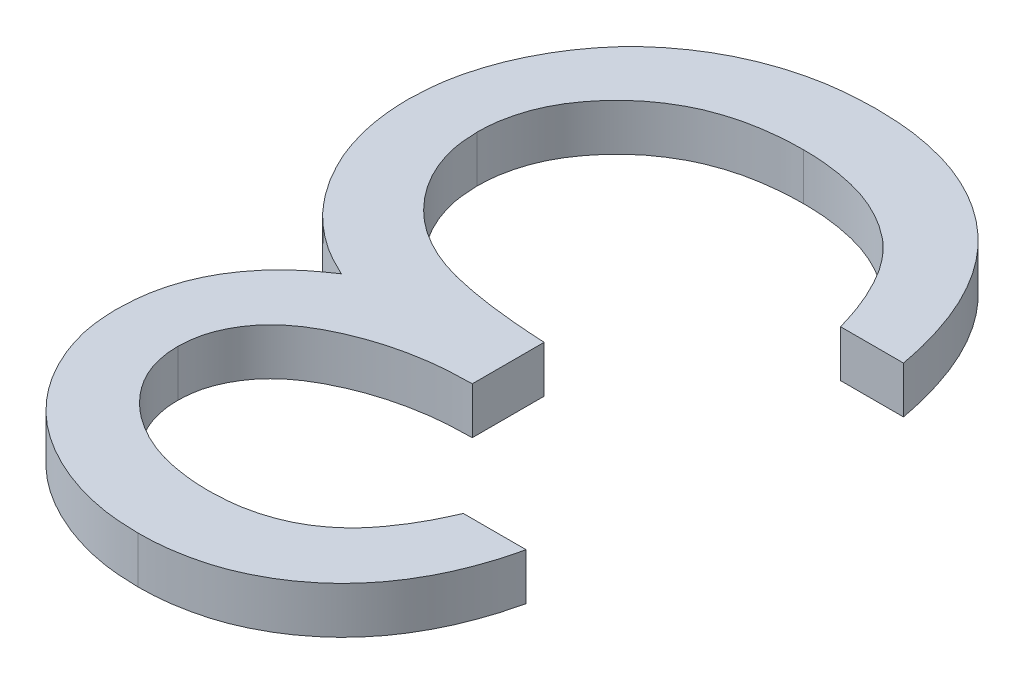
ISO-10303-21;
HEADER;
FILE_DESCRIPTION(('STEP AP214'),'2;1');
FILE_NAME('part.step','',(''),(''),'','','');
FILE_SCHEMA(('AUTOMOTIVE_DESIGN { 1 0 10303 214 1 1 1 1 }'));
ENDSEC;
DATA;
#1=APPLICATION_CONTEXT('core data for automotive mechanical design processes');
#2=APPLICATION_PROTOCOL_DEFINITION('international standard','automotive_design',2000,#1);
#3=PRODUCT_CONTEXT('',#1,'mechanical');
#4=PRODUCT('Part','Part','',(#3));
#5=PRODUCT_RELATED_PRODUCT_CATEGORY('part','',(#4));
#6=PRODUCT_DEFINITION_FORMATION('','',#4);
#7=PRODUCT_DEFINITION_CONTEXT('part definition',#1,'design');
#8=PRODUCT_DEFINITION('design','',#6,#7);
#9=PRODUCT_DEFINITION_SHAPE('','',#8);
#10=(LENGTH_UNIT() NAMED_UNIT(*) SI_UNIT(.MILLI.,.METRE.));
#11=(NAMED_UNIT(*) PLANE_ANGLE_UNIT() SI_UNIT($,.RADIAN.));
#12=(NAMED_UNIT(*) SI_UNIT($,.STERADIAN.) SOLID_ANGLE_UNIT());
#13=UNCERTAINTY_MEASURE_WITH_UNIT(LENGTH_MEASURE(1.E-05),#10,'distance_accuracy_value','');
#14=(GEOMETRIC_REPRESENTATION_CONTEXT(3) GLOBAL_UNCERTAINTY_ASSIGNED_CONTEXT((#13)) GLOBAL_UNIT_ASSIGNED_CONTEXT((#10,
#11,#12)) REPRESENTATION_CONTEXT('',''));
#15=CARTESIAN_POINT('',(0.,0.,0.));
#16=DIRECTION('',(0.,0.,1.));
#17=DIRECTION('',(1.,0.,0.));
#18=AXIS2_PLACEMENT_3D('',#15,#16,#17);
#19=CARTESIAN_POINT('',(-13.6790277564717,19.,16.3958219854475));
#20=DIRECTION('',(1.5653821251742E-13,-1.,1.57765180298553E-12));
#21=DIRECTION('',(-1.,-1.5653821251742E-13,0.));
#22=AXIS2_PLACEMENT_3D('',#19,#20,#21);
#23=PLANE('',#22);
#24=CARTESIAN_POINT('',(-14.0697115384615,19.,16.5192307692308));
#25=CARTESIAN_POINT('',(-14.035551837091,19.,16.5180404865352));
#26=CARTESIAN_POINT('',(-13.9688299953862,19.,16.5157155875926));
#27=CARTESIAN_POINT('',(-13.8726615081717,19.,16.4952807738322));
#28=CARTESIAN_POINT('',(-13.7833521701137,19.,16.4629039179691));
#29=CARTESIAN_POINT('',(-13.7153164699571,19.,16.4238089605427));
#30=CARTESIAN_POINT('',(-13.6649912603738,19.,16.3853499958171));
#31=CARTESIAN_POINT('',(-13.6283398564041,19.,16.352263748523));
#32=CARTESIAN_POINT('',(-13.5930041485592,19.,16.3147507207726));
#33=CARTESIAN_POINT('',(-13.5603707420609,19.,16.2717819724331));
#34=CARTESIAN_POINT('',(-13.5284841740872,19.,16.2248350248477));
#35=CARTESIAN_POINT('',(-13.4976489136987,19.,16.1736513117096));
#36=CARTESIAN_POINT('',(-13.4688553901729,19.,16.11750110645));
#37=CARTESIAN_POINT('',(-13.4513283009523,19.,16.0780146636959));
#38=CARTESIAN_POINT('',(-13.4423076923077,19.,16.0576923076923));
#39=(BOUNDED_CURVE() B_SPLINE_CURVE(3,(#24,#25,#26,#27,#28,#29,#30,#31,#32,#33,#34,#35,#36,#37,
#38),.UNSPECIFIED.,.F.,.F.) B_SPLINE_CURVE_WITH_KNOTS((4,1,1,1,1,1,1,1,1,1,1,1,4),(0.,
0.122728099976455,0.239716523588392,0.351862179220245,0.463201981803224,0.520261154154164,
0.579432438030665,0.640596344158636,0.705298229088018,0.773236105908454,0.844648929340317,
0.920045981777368,1.),
.UNSPECIFIED.) CURVE() GEOMETRIC_REPRESENTATION_ITEM() RATIONAL_B_SPLINE_CURVE((1.,1.,1.,1.,1.,
1.,1.,1.,1.,1.,1.,1.,1.,1.,1.)) REPRESENTATION_ITEM(''));
#40=CARTESIAN_POINT('',(-14.0697115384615,19.,16.5192307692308));
#41=VERTEX_POINT('',#40);
#42=CARTESIAN_POINT('',(-13.4423076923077,19.,16.0576923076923));
#43=VERTEX_POINT('',#42);
#44=EDGE_CURVE('E202',#41,#43,#39,.T.);
#45=ORIENTED_EDGE('',*,*,#44,.T.);
#46=DIRECTION('',(1.,0.,0.));
#47=VECTOR('',#46,1.);
#48=CARTESIAN_POINT('',(-13.4423076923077,19.,16.0576923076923));
#49=LINE('',#48,#47);
#50=CARTESIAN_POINT('',(-13.1730769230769,19.,16.0576923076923));
#51=VERTEX_POINT('',#50);
#52=EDGE_CURVE('E23',#43,#51,#49,.T.);
#53=ORIENTED_EDGE('',*,*,#52,.T.);
#54=CARTESIAN_POINT('',(-13.1730769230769,19.,16.0576923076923));
#55=CARTESIAN_POINT('',(-13.1803708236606,19.,16.0878915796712));
#56=CARTESIAN_POINT('',(-13.1946298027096,19.,16.1469286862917));
#57=CARTESIAN_POINT('',(-13.2243705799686,19.,16.231277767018));
#58=CARTESIAN_POINT('',(-13.256769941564,19.,16.3110979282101));
#59=CARTESIAN_POINT('',(-13.2956748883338,19.,16.3848945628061));
#60=CARTESIAN_POINT('',(-13.3381109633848,19.,16.4541507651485));
#61=CARTESIAN_POINT('',(-13.3867304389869,19.,16.5172957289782));
#62=CARTESIAN_POINT('',(-13.4392902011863,19.,16.5759354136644));
#63=CARTESIAN_POINT('',(-13.4974258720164,19.,16.6279753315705));
#64=CARTESIAN_POINT('',(-13.5583932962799,19.,16.675099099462));
#65=CARTESIAN_POINT('',(-13.6230515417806,19.,16.7152777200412));
#66=CARTESIAN_POINT('',(-13.6900997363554,19.,16.7498412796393));
#67=CARTESIAN_POINT('',(-13.7600024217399,19.,16.7783157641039));
#68=CARTESIAN_POINT('',(-13.8329677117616,19.,16.7997662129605));
#69=CARTESIAN_POINT('',(-13.9083359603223,19.,16.8153291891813));
#70=CARTESIAN_POINT('',(-13.9863046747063,19.,16.8254358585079));
#71=CARTESIAN_POINT('',(-14.0392311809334,19.,16.8264222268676));
#72=CARTESIAN_POINT('',(-14.0661057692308,19.,16.826923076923));
#73=(BOUNDED_CURVE() B_SPLINE_CURVE(3,(#54,#55,#56,#57,#58,#59,#60,#61,#62,#63,#64,#65,#66,#67,
#68,#69,#70,#71,#72),.UNSPECIFIED.,.F.,.F.) B_SPLINE_CURVE_WITH_KNOTS((4,1,1,1,1,1,1,1,1,1,1,1,
1,1,1,1,4),(0.,0.0726253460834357,0.141976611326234,0.208984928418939,0.273956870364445,
0.336889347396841,0.398744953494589,0.460115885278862,0.52082492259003,0.580994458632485,
0.640151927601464,0.698622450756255,0.757271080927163,0.816426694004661,0.87625404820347,
0.937165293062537,1.),
.UNSPECIFIED.) CURVE() GEOMETRIC_REPRESENTATION_ITEM() RATIONAL_B_SPLINE_CURVE((1.,1.,1.,1.,1.,
1.,1.,1.,1.,1.,1.,1.,1.,1.,1.,1.,1.,1.,1.)) REPRESENTATION_ITEM(''));
#74=CARTESIAN_POINT('',(-14.0661057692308,19.,16.826923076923));
#75=VERTEX_POINT('',#74);
#76=EDGE_CURVE('E464',#51,#75,#73,.T.);
#77=ORIENTED_EDGE('',*,*,#76,.T.);
#78=CARTESIAN_POINT('',(-14.0661057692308,19.,16.826923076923));
#79=CARTESIAN_POINT('',(-14.1052624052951,19.,16.8257408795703));
#80=CARTESIAN_POINT('',(-14.1827215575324,19.,16.8234022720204));
#81=CARTESIAN_POINT('',(-14.2965184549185,19.,16.8020470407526));
#82=CARTESIAN_POINT('',(-14.4062557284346,19.,16.7682540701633));
#83=CARTESIAN_POINT('',(-14.5107322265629,19.,16.7215623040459));
#84=CARTESIAN_POINT('',(-14.6077765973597,19.,16.6639731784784));
#85=CARTESIAN_POINT('',(-14.6941219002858,19.,16.5954319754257));
#86=CARTESIAN_POINT('',(-14.7685977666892,19.,16.5172611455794));
#87=CARTESIAN_POINT('',(-14.8310786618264,19.,16.430918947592));
#88=CARTESIAN_POINT('',(-14.8800000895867,19.,16.338642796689));
#89=CARTESIAN_POINT('',(-14.9160741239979,19.,16.2436712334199));
#90=CARTESIAN_POINT('',(-14.9380355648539,19.,16.1462295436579));
#91=CARTESIAN_POINT('',(-14.9408817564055,19.,16.0804375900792));
#92=CARTESIAN_POINT('',(-14.9423076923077,19.,16.0474759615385));
#93=(BOUNDED_CURVE() B_SPLINE_CURVE(3,(#78,#79,#80,#81,#82,#83,#84,#85,#86,#87,#88,#89,#90,#91,
#92),.UNSPECIFIED.,.F.,.F.) B_SPLINE_CURVE_WITH_KNOTS((4,1,1,1,1,1,1,1,1,1,1,1,4),(0.,
0.090254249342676,0.178539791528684,0.266093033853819,0.354630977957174,0.441886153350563,
0.525746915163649,0.608113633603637,0.690197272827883,0.770821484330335,0.84832618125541,
0.924011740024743,1.),
.UNSPECIFIED.) CURVE() GEOMETRIC_REPRESENTATION_ITEM() RATIONAL_B_SPLINE_CURVE((1.,1.,1.,1.,1.,
1.,1.,1.,1.,1.,1.,1.,1.,1.,1.)) REPRESENTATION_ITEM(''));
#94=CARTESIAN_POINT('',(-14.9423076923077,19.,16.0474759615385));
#95=VERTEX_POINT('',#94);
#96=EDGE_CURVE('E444',#75,#95,#93,.T.);
#97=ORIENTED_EDGE('',*,*,#96,.T.);
#98=CARTESIAN_POINT('',(-14.9423076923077,19.,16.0474759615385));
#99=CARTESIAN_POINT('',(-14.9413103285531,19.,16.0157558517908));
#100=CARTESIAN_POINT('',(-14.9393586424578,19.,15.9536845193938));
#101=CARTESIAN_POINT('',(-14.922786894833,19.,15.8630660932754));
#102=CARTESIAN_POINT('',(-14.8948986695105,19.,15.7776590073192));
#103=CARTESIAN_POINT('',(-14.8562674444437,19.,15.6971037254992));
#104=CARTESIAN_POINT('',(-14.8062604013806,19.,15.6219110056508));
#105=CARTESIAN_POINT('',(-14.7456838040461,19.,15.5519116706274));
#106=CARTESIAN_POINT('',(-14.6741100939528,19.,15.4867952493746));
#107=CARTESIAN_POINT('',(-14.6198710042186,19.,15.4494928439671));
#108=CARTESIAN_POINT('',(-14.5919471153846,19.,15.4302884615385));
#109=(BOUNDED_CURVE() B_SPLINE_CURVE(3,(#98,#99,#100,#101,#102,#103,#104,#105,#106,#107,#108),
.UNSPECIFIED.,.F.,.F.) B_SPLINE_CURVE_WITH_KNOTS((4,1,1,1,1,1,1,1,4),(0.,0.128067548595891,
0.250608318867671,0.370630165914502,0.490072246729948,0.610374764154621,0.734313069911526,
0.863216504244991,1.),
.UNSPECIFIED.) CURVE() GEOMETRIC_REPRESENTATION_ITEM() RATIONAL_B_SPLINE_CURVE((1.,1.,1.,1.,1.,
1.,1.,1.,1.,1.,1.)) REPRESENTATION_ITEM(''));
#110=CARTESIAN_POINT('',(-14.5919471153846,19.,15.4302884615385));
#111=VERTEX_POINT('',#110);
#112=EDGE_CURVE('E424',#95,#111,#109,.T.);
#113=ORIENTED_EDGE('',*,*,#112,.T.);
#114=CARTESIAN_POINT('',(-14.5919471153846,19.,15.4302884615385));
#115=CARTESIAN_POINT('',(-14.6239007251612,19.,15.414934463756));
#116=CARTESIAN_POINT('',(-14.6873126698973,19.,15.3844644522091));
#117=CARTESIAN_POINT('',(-14.7728738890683,19.,15.3237586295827));
#118=CARTESIAN_POINT('',(-14.8517297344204,19.,15.2553888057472));
#119=CARTESIAN_POINT('',(-14.8951892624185,19.,15.2014382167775));
#120=CARTESIAN_POINT('',(-14.9170673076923,19.,15.1742788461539));
#121=(BOUNDED_CURVE() B_SPLINE_CURVE(3,(#114,#115,#116,#117,#118,#119,#120),.UNSPECIFIED.,.F.,
.F.) B_SPLINE_CURVE_WITH_KNOTS((4,1,1,1,4),(0.,0.253915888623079,0.503896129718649,
0.7502553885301,1.),
.UNSPECIFIED.) CURVE() GEOMETRIC_REPRESENTATION_ITEM() RATIONAL_B_SPLINE_CURVE((1.,1.,1.,1.,1.,
1.,1.)) REPRESENTATION_ITEM(''));
#122=CARTESIAN_POINT('',(-14.9170673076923,19.,15.1742788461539));
#123=VERTEX_POINT('',#122);
#124=EDGE_CURVE('E404',#111,#123,#121,.T.);
#125=ORIENTED_EDGE('',*,*,#124,.T.);
#126=CARTESIAN_POINT('',(-14.9170673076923,19.,15.1742788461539));
#127=CARTESIAN_POINT('',(-14.9315086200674,19.,15.1545171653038));
#128=CARTESIAN_POINT('',(-14.9601547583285,19.,15.1153174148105));
#129=CARTESIAN_POINT('',(-14.9954136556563,19.,15.0522554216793));
#130=CARTESIAN_POINT('',(-15.0277660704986,19.,14.9887032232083));
#131=CARTESIAN_POINT('',(-15.0515765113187,19.,14.9221620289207));
#132=CARTESIAN_POINT('',(-15.0721239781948,19.,14.8547692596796));
#133=CARTESIAN_POINT('',(-15.0856435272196,19.,14.7850817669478));
#134=CARTESIAN_POINT('',(-15.0943225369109,19.,14.7137616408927));
#135=CARTESIAN_POINT('',(-15.0955412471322,19.,14.6654901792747));
#136=CARTESIAN_POINT('',(-15.0961538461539,19.,14.6412259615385));
#137=(BOUNDED_CURVE() B_SPLINE_CURVE(3,(#126,#127,#128,#129,#130,#131,#132,#133,#134,#135,#136),
.UNSPECIFIED.,.F.,.F.) B_SPLINE_CURVE_WITH_KNOTS((4,1,1,1,1,1,1,1,4),(0.,0.128145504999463,
0.254192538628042,0.378141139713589,0.501380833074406,0.623956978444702,0.747075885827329,
0.872864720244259,1.),
.UNSPECIFIED.) CURVE() GEOMETRIC_REPRESENTATION_ITEM() RATIONAL_B_SPLINE_CURVE((1.,1.,1.,1.,1.,
1.,1.,1.,1.,1.,1.)) REPRESENTATION_ITEM(''));
#138=CARTESIAN_POINT('',(-15.0961538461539,19.,14.6412259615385));
#139=VERTEX_POINT('',#138);
#140=EDGE_CURVE('E384',#123,#139,#137,.T.);
#141=ORIENTED_EDGE('',*,*,#140,.T.);
#142=CARTESIAN_POINT('',(-15.0961538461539,19.,14.6412259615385));
#143=CARTESIAN_POINT('',(-15.094612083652,19.,14.5992195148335));
#144=CARTESIAN_POINT('',(-15.0915358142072,19.,14.5154043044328));
#145=CARTESIAN_POINT('',(-15.0641578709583,19.,14.3915405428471));
#146=CARTESIAN_POINT('',(-15.0214517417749,19.,14.2706867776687));
#147=CARTESIAN_POINT('',(-14.9619336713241,19.,14.1545569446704));
#148=CARTESIAN_POINT('',(-14.8879617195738,19.,14.0462335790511));
#149=CARTESIAN_POINT('',(-14.8004428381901,19.,13.9490346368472));
#150=CARTESIAN_POINT('',(-14.69928383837,19.,13.866247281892));
#151=CARTESIAN_POINT('',(-14.5874300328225,19.,13.7964626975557));
#152=CARTESIAN_POINT('',(-14.4657787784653,19.,13.7411592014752));
#153=CARTESIAN_POINT('',(-14.3361801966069,19.,13.7013085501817));
#154=CARTESIAN_POINT('',(-14.1994016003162,19.,13.6774037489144));
#155=CARTESIAN_POINT('',(-14.1058649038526,19.,13.6745356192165));
#156=CARTESIAN_POINT('',(-14.0582932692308,19.,13.6730769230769));
#157=(BOUNDED_CURVE() B_SPLINE_CURVE(3,(#142,#143,#144,#145,#146,#147,#148,#149,#150,#151,#152,
#153,#154,#155,#156),.UNSPECIFIED.,.F.,.F.) B_SPLINE_CURVE_WITH_KNOTS((4,1,1,1,1,1,1,1,1,1,1,1,
4),(0.,0.0796349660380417,0.158895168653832,0.239579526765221,0.322382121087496,
0.405793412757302,0.487884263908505,0.569710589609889,0.653048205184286,0.737433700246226,
0.822572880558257,0.909762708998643,1.),
.UNSPECIFIED.) CURVE() GEOMETRIC_REPRESENTATION_ITEM() RATIONAL_B_SPLINE_CURVE((1.,1.,1.,1.,1.,
1.,1.,1.,1.,1.,1.,1.,1.,1.,1.)) REPRESENTATION_ITEM(''));
#158=CARTESIAN_POINT('',(-14.0582932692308,19.,13.6730769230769));
#159=VERTEX_POINT('',#158);
#160=EDGE_CURVE('E364',#139,#159,#157,.T.);
#161=ORIENTED_EDGE('',*,*,#160,.T.);
#162=CARTESIAN_POINT('',(-14.0582932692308,19.,13.6730769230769));
#163=CARTESIAN_POINT('',(-14.0262216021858,19.,13.6738275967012));
#164=CARTESIAN_POINT('',(-13.9631152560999,19.,13.6753046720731));
#165=CARTESIAN_POINT('',(-13.8703063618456,19.,13.6852224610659));
#166=CARTESIAN_POINT('',(-13.7819036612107,19.,13.7038289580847));
#167=CARTESIAN_POINT('',(-13.6970487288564,19.,13.7272292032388));
#168=CARTESIAN_POINT('',(-13.6170222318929,19.,13.7595826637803));
#169=CARTESIAN_POINT('',(-13.5406730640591,19.,13.7981539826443));
#170=CARTESIAN_POINT('',(-13.4683358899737,19.,13.8439322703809));
#171=CARTESIAN_POINT('',(-13.4004402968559,19.,13.8969945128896));
#172=CARTESIAN_POINT('',(-13.3370588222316,19.,13.9563897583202));
#173=CARTESIAN_POINT('',(-13.2798062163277,19.,14.0231047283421));
#174=CARTESIAN_POINT('',(-13.2280490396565,19.,14.0958942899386));
#175=CARTESIAN_POINT('',(-13.1821161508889,19.,14.1754131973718));
#176=CARTESIAN_POINT('',(-13.1418142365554,19.,14.2614387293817));
#177=CARTESIAN_POINT('',(-13.1080105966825,19.,14.3543156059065));
#178=CARTESIAN_POINT('',(-13.0784958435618,19.,14.4533238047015));
#179=CARTESIAN_POINT('',(-13.064746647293,19.,14.5223016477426));
#180=CARTESIAN_POINT('',(-13.0576923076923,19.,14.5576923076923));
#181=(BOUNDED_CURVE() B_SPLINE_CURVE(3,(#162,#163,#164,#165,#166,#167,#168,#169,#170,#171,#172,
#173,#174,#175,#176,#177,#178,#179,#180),.UNSPECIFIED.,.F.,.F.) B_SPLINE_CURVE_WITH_KNOTS((4,1,
1,1,1,1,1,1,1,1,1,1,1,1,1,1,4),(0.,0.0655377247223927,0.128956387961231,0.190367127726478,
0.249965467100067,0.308568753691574,0.366415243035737,0.424556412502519,0.483181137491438,
0.542251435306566,0.601744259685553,0.662507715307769,0.724499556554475,0.789138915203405,
0.856353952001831,0.926299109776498,1.),
.UNSPECIFIED.) CURVE() GEOMETRIC_REPRESENTATION_ITEM() RATIONAL_B_SPLINE_CURVE((1.,1.,1.,1.,1.,
1.,1.,1.,1.,1.,1.,1.,1.,1.,1.,1.,1.,1.,1.)) REPRESENTATION_ITEM(''));
#182=CARTESIAN_POINT('',(-13.0576923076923,19.,14.5576923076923));
#183=VERTEX_POINT('',#182);
#184=EDGE_CURVE('E347',#159,#183,#181,.T.);
#185=ORIENTED_EDGE('',*,*,#184,.T.);
#186=DIRECTION('',(-1.,0.,0.));
#187=VECTOR('',#186,1.);
#188=CARTESIAN_POINT('',(-13.0576923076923,19.,14.5576923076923));
#189=LINE('',#188,#187);
#190=CARTESIAN_POINT('',(-13.3269230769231,19.,14.5576923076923));
#191=VERTEX_POINT('',#190);
#192=EDGE_CURVE('E334',#183,#191,#189,.T.);
#193=ORIENTED_EDGE('',*,*,#192,.T.);
#194=CARTESIAN_POINT('',(-13.3269230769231,19.,14.5576923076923));
#195=CARTESIAN_POINT('',(-13.333937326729,19.,14.534593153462));
#196=CARTESIAN_POINT('',(-13.3475806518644,19.,14.4896632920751));
#197=CARTESIAN_POINT('',(-13.3708043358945,19.,14.4250001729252));
#198=CARTESIAN_POINT('',(-13.397262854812,19.,14.3657218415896));
#199=CARTESIAN_POINT('',(-13.4256467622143,19.,14.3113934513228));
#200=CARTESIAN_POINT('',(-13.4554568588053,19.,14.2614799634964));
#201=CARTESIAN_POINT('',(-13.4888125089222,19.,14.21730121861));
#202=CARTESIAN_POINT('',(-13.5232432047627,19.,14.1769167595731));
#203=CARTESIAN_POINT('',(-13.5491969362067,19.,14.1541642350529));
#204=CARTESIAN_POINT('',(-13.5618990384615,19.,14.1430288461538));
#205=(BOUNDED_CURVE() B_SPLINE_CURVE(3,(#194,#195,#196,#197,#198,#199,#200,#201,#202,#203,#204),
.UNSPECIFIED.,.F.,.F.) B_SPLINE_CURVE_WITH_KNOTS((4,1,1,1,1,1,1,1,4),(0.,0.14977038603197,
0.291316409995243,0.425966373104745,0.552159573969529,0.671527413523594,0.78612162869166,
0.895325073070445,1.),
.UNSPECIFIED.) CURVE() GEOMETRIC_REPRESENTATION_ITEM() RATIONAL_B_SPLINE_CURVE((1.,1.,1.,1.,1.,
1.,1.,1.,1.,1.,1.)) REPRESENTATION_ITEM(''));
#206=CARTESIAN_POINT('',(-13.5618990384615,19.,14.1430288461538));
#207=VERTEX_POINT('',#206);
#208=EDGE_CURVE('E314',#191,#207,#205,.T.);
#209=ORIENTED_EDGE('',*,*,#208,.T.);
#210=CARTESIAN_POINT('',(-13.5618990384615,19.,14.1430288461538));
#211=CARTESIAN_POINT('',(-13.5786979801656,19.,14.1300841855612));
#212=CARTESIAN_POINT('',(-13.6122440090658,19.,14.1042348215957));
#213=CARTESIAN_POINT('',(-13.6668743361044,19.,14.0711532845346));
#214=CARTESIAN_POINT('',(-13.7245297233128,19.,14.042836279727));
#215=CARTESIAN_POINT('',(-13.7856909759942,19.,14.0198190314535));
#216=CARTESIAN_POINT('',(-13.8503662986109,19.,14.0025414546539));
#217=CARTESIAN_POINT('',(-13.9182933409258,19.,13.9901058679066));
#218=CARTESIAN_POINT('',(-13.989583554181,19.,13.9818964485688));
#219=CARTESIAN_POINT('',(-14.0382377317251,19.,13.9811504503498));
#220=CARTESIAN_POINT('',(-14.0631009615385,19.,13.9807692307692));
#221=(BOUNDED_CURVE() B_SPLINE_CURVE(3,(#210,#211,#212,#213,#214,#215,#216,#217,#218,#219,#220),
.UNSPECIFIED.,.F.,.F.) B_SPLINE_CURVE_WITH_KNOTS((4,1,1,1,1,1,1,1,4),(0.,0.118260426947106,
0.236155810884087,0.355630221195,0.476249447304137,0.60016411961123,0.728633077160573,
0.861326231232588,1.),
.UNSPECIFIED.) CURVE() GEOMETRIC_REPRESENTATION_ITEM() RATIONAL_B_SPLINE_CURVE((1.,1.,1.,1.,1.,
1.,1.,1.,1.,1.,1.)) REPRESENTATION_ITEM(''));
#222=CARTESIAN_POINT('',(-14.0631009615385,19.,13.9807692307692));
#223=VERTEX_POINT('',#222);
#224=EDGE_CURVE('E294',#207,#223,#221,.T.);
#225=ORIENTED_EDGE('',*,*,#224,.T.);
#226=CARTESIAN_POINT('',(-14.0631009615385,19.,13.9807692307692));
#227=CARTESIAN_POINT('',(-14.09117577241,19.,13.9812962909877));
#228=CARTESIAN_POINT('',(-14.1460736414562,19.,13.9823269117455));
#229=CARTESIAN_POINT('',(-14.2261724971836,19.,13.9918323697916));
#230=CARTESIAN_POINT('',(-14.3023978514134,19.,14.0056155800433));
#231=CARTESIAN_POINT('',(-14.3739718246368,19.,14.0271752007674));
#232=CARTESIAN_POINT('',(-14.4418683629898,19.,14.0530395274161));
#233=CARTESIAN_POINT('',(-14.504571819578,19.,14.0869006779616));
#234=CARTESIAN_POINT('',(-14.5639255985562,19.,14.1251413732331));
#235=CARTESIAN_POINT('',(-14.6181909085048,19.,14.169622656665));
#236=CARTESIAN_POINT('',(-14.6671137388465,19.,14.2177021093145));
#237=CARTESIAN_POINT('',(-14.7093884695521,19.,14.2687101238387));
#238=CARTESIAN_POINT('',(-14.7460032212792,19.,14.3210651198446));
#239=CARTESIAN_POINT('',(-14.7754353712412,19.,14.3759884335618));
#240=CARTESIAN_POINT('',(-14.7987175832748,19.,14.4329413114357));
#241=CARTESIAN_POINT('',(-14.8145575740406,19.,14.4921369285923));
#242=CARTESIAN_POINT('',(-14.8255738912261,19.,14.553076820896));
#243=CARTESIAN_POINT('',(-14.826470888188,19.,14.5945017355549));
#244=CARTESIAN_POINT('',(-14.8269230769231,19.,14.6153846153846));
#245=(BOUNDED_CURVE() B_SPLINE_CURVE(3,(#226,#227,#228,#229,#230,#231,#232,#233,#234,#235,#236,
#237,#238,#239,#240,#241,#242,#243,#244),.UNSPECIFIED.,.F.,.F.) B_SPLINE_CURVE_WITH_KNOTS((4,1,
1,1,1,1,1,1,1,1,1,1,1,1,1,1,4),(0.,0.0760618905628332,0.148732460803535,0.218374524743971,
0.285722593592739,0.351057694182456,0.414934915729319,0.478485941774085,0.542169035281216,
0.604750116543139,0.664118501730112,0.721499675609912,0.777615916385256,0.832666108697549,
0.887858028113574,0.943467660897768,1.),
.UNSPECIFIED.) CURVE() GEOMETRIC_REPRESENTATION_ITEM() RATIONAL_B_SPLINE_CURVE((1.,1.,1.,1.,1.,
1.,1.,1.,1.,1.,1.,1.,1.,1.,1.,1.,1.,1.,1.)) REPRESENTATION_ITEM(''));
#246=CARTESIAN_POINT('',(-14.8269230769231,19.,14.6153846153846));
#247=VERTEX_POINT('',#246);
#248=EDGE_CURVE('E180',#223,#247,#245,.T.);
#249=ORIENTED_EDGE('',*,*,#248,.T.);
#250=CARTESIAN_POINT('',(-14.8269230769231,19.,14.6153846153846));
#251=CARTESIAN_POINT('',(-14.8256086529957,19.,14.6433354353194));
#252=CARTESIAN_POINT('',(-14.8229863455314,19.,14.6990979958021));
#253=CARTESIAN_POINT('',(-14.8030485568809,19.,14.7811679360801));
#254=CARTESIAN_POINT('',(-14.7699604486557,19.,14.8602725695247));
#255=CARTESIAN_POINT('',(-14.7245391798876,19.,14.9353759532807));
#256=CARTESIAN_POINT('',(-14.6679223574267,19.,15.0041679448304));
#257=CARTESIAN_POINT('',(-14.6027862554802,19.,15.0657441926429));
#258=CARTESIAN_POINT('',(-14.5277410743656,19.,15.1170158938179));
#259=CARTESIAN_POINT('',(-14.4582784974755,19.,15.1523414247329));
#260=CARTESIAN_POINT('',(-14.3965908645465,19.,15.1758774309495));
#261=CARTESIAN_POINT('',(-14.3439064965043,19.,15.192381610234));
#262=CARTESIAN_POINT('',(-14.2848720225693,19.,15.2055744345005));
#263=CARTESIAN_POINT('',(-14.2201967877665,19.,15.2183359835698));
#264=CARTESIAN_POINT('',(-14.1496078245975,19.,15.2290344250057));
#265=CARTESIAN_POINT('',(-14.073041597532,19.,15.237994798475));
#266=CARTESIAN_POINT('',(-13.9904672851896,19.,15.2451532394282));
#267=CARTESIAN_POINT('',(-13.9333035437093,19.,15.2483517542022));
#268=CARTESIAN_POINT('',(-13.9038461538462,19.,15.25));
#269=(BOUNDED_CURVE() B_SPLINE_CURVE(3,(#250,#251,#252,#253,#254,#255,#256,#257,#258,#259,#260,
#261,#262,#263,#264,#265,#266,#267,#268),.UNSPECIFIED.,.F.,.F.) B_SPLINE_CURVE_WITH_KNOTS((4,1,
1,1,1,1,1,1,1,1,1,1,1,1,1,1,4),(0.,0.0669025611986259,0.133472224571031,0.201015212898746,
0.271617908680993,0.342884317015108,0.413833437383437,0.485571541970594,0.559817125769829,
0.59991528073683,0.643623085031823,0.691922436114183,0.744712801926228,0.801511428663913,
0.862871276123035,0.9293353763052,1.),
.UNSPECIFIED.) CURVE() GEOMETRIC_REPRESENTATION_ITEM() RATIONAL_B_SPLINE_CURVE((1.,1.,1.,1.,1.,
1.,1.,1.,1.,1.,1.,1.,1.,1.,1.,1.,1.,1.,1.)) REPRESENTATION_ITEM(''));
#270=CARTESIAN_POINT('',(-13.9038461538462,19.,15.25));
#271=VERTEX_POINT('',#270);
#272=EDGE_CURVE('E192',#247,#271,#269,.T.);
#273=ORIENTED_EDGE('',*,*,#272,.T.);
#274=DIRECTION('',(0.,0.,1.));
#275=VECTOR('',#274,1.);
#276=CARTESIAN_POINT('',(-13.9038461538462,19.,15.25));
#277=LINE('',#276,#275);
#278=CARTESIAN_POINT('',(-13.9038461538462,19.,15.5576923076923));
#279=VERTEX_POINT('',#278);
#280=EDGE_CURVE('E195',#271,#279,#277,.T.);
#281=ORIENTED_EDGE('',*,*,#280,.T.);
#282=CARTESIAN_POINT('',(-13.9038461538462,19.,15.5576923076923));
#283=CARTESIAN_POINT('',(-13.9409470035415,19.,15.5584156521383));
#284=CARTESIAN_POINT('',(-14.0135930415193,19.,15.5598320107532));
#285=CARTESIAN_POINT('',(-14.1200086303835,19.,15.5734349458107));
#286=CARTESIAN_POINT('',(-14.221455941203,19.,15.5955144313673));
#287=CARTESIAN_POINT('',(-14.3164090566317,19.,15.6263402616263));
#288=CARTESIAN_POINT('',(-14.4025077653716,19.,15.6638682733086));
#289=CARTESIAN_POINT('',(-14.4779180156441,19.,15.7058853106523));
#290=CARTESIAN_POINT('',(-14.539926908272,19.,15.7543586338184));
#291=CARTESIAN_POINT('',(-14.5896450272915,19.,15.806996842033));
#292=CARTESIAN_POINT('',(-14.6265214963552,19.,15.8638110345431));
#293=CARTESIAN_POINT('',(-14.6537415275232,19.,15.9227571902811));
#294=CARTESIAN_POINT('',(-14.6698416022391,19.,15.9849319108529));
#295=CARTESIAN_POINT('',(-14.6719946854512,19.,16.027354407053));
#296=CARTESIAN_POINT('',(-14.6730769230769,19.,16.0486778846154));
#297=(BOUNDED_CURVE() B_SPLINE_CURVE(3,(#282,#283,#284,#285,#286,#287,#288,#289,#290,#291,#292,
#293,#294,#295,#296),.UNSPECIFIED.,.F.,.F.) B_SPLINE_CURVE_WITH_KNOTS((4,1,1,1,1,1,1,1,1,1,1,1,
4),(0.,0.11015137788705,0.215684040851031,0.318037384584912,0.418136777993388,0.511655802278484,
0.596672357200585,0.673800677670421,0.744526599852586,0.810701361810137,0.874075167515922,
0.936704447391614,1.),
.UNSPECIFIED.) CURVE() GEOMETRIC_REPRESENTATION_ITEM() RATIONAL_B_SPLINE_CURVE((1.,1.,1.,1.,1.,
1.,1.,1.,1.,1.,1.,1.,1.,1.,1.)) REPRESENTATION_ITEM(''));
#298=CARTESIAN_POINT('',(-14.6730769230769,19.,16.0486778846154));
#299=VERTEX_POINT('',#298);
#300=EDGE_CURVE('E252',#279,#299,#297,.T.);
#301=ORIENTED_EDGE('',*,*,#300,.T.);
#302=CARTESIAN_POINT('',(-14.6730769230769,19.,16.0486778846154));
#303=CARTESIAN_POINT('',(-14.6727295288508,19.,16.0643471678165));
#304=CARTESIAN_POINT('',(-14.6720384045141,19.,16.095520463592));
#305=CARTESIAN_POINT('',(-14.6629743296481,19.,16.1412061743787));
#306=CARTESIAN_POINT('',(-14.6499831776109,19.,16.1854958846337));
#307=CARTESIAN_POINT('',(-14.6311096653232,19.,16.2278720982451));
#308=CARTESIAN_POINT('',(-14.6067004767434,19.,16.2684695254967));
#309=CARTESIAN_POINT('',(-14.5771689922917,19.,16.3074364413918));
#310=CARTESIAN_POINT('',(-14.5424404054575,19.,16.345144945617));
#311=CARTESIAN_POINT('',(-14.5027402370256,19.,16.3807633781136));
#312=CARTESIAN_POINT('',(-14.4584338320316,19.,16.4128205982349));
#313=CARTESIAN_POINT('',(-14.4112994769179,19.,16.4413991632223));
#314=CARTESIAN_POINT('',(-14.3611534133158,19.,16.4654296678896));
#315=CARTESIAN_POINT('',(-14.3083224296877,19.,16.4853493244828));
#316=CARTESIAN_POINT('',(-14.2525209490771,19.,16.5003073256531));
#317=CARTESIAN_POINT('',(-14.1940425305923,19.,16.5110543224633));
#318=CARTESIAN_POINT('',(-14.1327669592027,19.,16.5177717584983));
#319=CARTESIAN_POINT('',(-14.0909626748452,19.,16.518739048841));
#320=CARTESIAN_POINT('',(-14.0697115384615,19.,16.5192307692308));
#321=(BOUNDED_CURVE() B_SPLINE_CURVE(3,(#302,#303,#304,#305,#306,#307,#308,#309,#310,#311,#312,
#313,#314,#315,#316,#317,#318,#319,#320),.UNSPECIFIED.,.F.,.F.) B_SPLINE_CURVE_WITH_KNOTS((4,1,
1,1,1,1,1,1,1,1,1,1,1,1,1,1,4),(0.,0.0552654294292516,0.109947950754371,0.163897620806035,
0.218069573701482,0.273285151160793,0.330884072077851,0.390478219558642,0.4541190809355,
0.518940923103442,0.58337928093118,0.648574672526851,0.715077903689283,0.782537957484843,
0.852347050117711,0.924940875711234,1.),
.UNSPECIFIED.) CURVE() GEOMETRIC_REPRESENTATION_ITEM() RATIONAL_B_SPLINE_CURVE((1.,1.,1.,1.,1.,
1.,1.,1.,1.,1.,1.,1.,1.,1.,1.,1.,1.,1.,1.)) REPRESENTATION_ITEM(''));
#322=EDGE_CURVE('E235',#299,#41,#321,.T.);
#323=ORIENTED_EDGE('',*,*,#322,.T.);
#324=EDGE_LOOP('',(#45,#53,#77,#97,#113,#125,#141,#161,#185,#193,#209,#225,#249,#273,#281,#301,#323));
#325=FACE_BOUND('',#324,.T.);
#326=ADVANCED_FACE('F15',(#325),#23,.T.);
#327=CARTESIAN_POINT('',(-13.6790277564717,19.2,16.3958219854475));
#328=DIRECTION('',(1.5653821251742E-13,-1.,1.57765180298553E-12));
#329=DIRECTION('',(-1.,-1.5653821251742E-13,0.));
#330=AXIS2_PLACEMENT_3D('',#327,#328,#329);
#331=PLANE('',#330);
#332=CARTESIAN_POINT('',(-14.0697115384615,19.2,16.5192307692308));
#333=CARTESIAN_POINT('',(-14.035551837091,19.2,16.5180404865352));
#334=CARTESIAN_POINT('',(-13.9688299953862,19.2,16.5157155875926));
#335=CARTESIAN_POINT('',(-13.8726615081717,19.2,16.4952807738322));
#336=CARTESIAN_POINT('',(-13.7833521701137,19.2,16.4629039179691));
#337=CARTESIAN_POINT('',(-13.7153164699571,19.2,16.4238089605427));
#338=CARTESIAN_POINT('',(-13.6649912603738,19.2,16.3853499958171));
#339=CARTESIAN_POINT('',(-13.6283398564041,19.2,16.352263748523));
#340=CARTESIAN_POINT('',(-13.5930041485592,19.2,16.3147507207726));
#341=CARTESIAN_POINT('',(-13.5603707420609,19.2,16.2717819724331));
#342=CARTESIAN_POINT('',(-13.5284841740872,19.2,16.2248350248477));
#343=CARTESIAN_POINT('',(-13.4976489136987,19.2,16.1736513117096));
#344=CARTESIAN_POINT('',(-13.4688553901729,19.2,16.11750110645));
#345=CARTESIAN_POINT('',(-13.4513283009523,19.2,16.0780146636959));
#346=CARTESIAN_POINT('',(-13.4423076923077,19.2,16.0576923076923));
#347=(BOUNDED_CURVE() B_SPLINE_CURVE(3,(#332,#333,#334,#335,#336,#337,#338,#339,#340,#341,#342,
#343,#344,#345,#346),.UNSPECIFIED.,.F.,.F.) B_SPLINE_CURVE_WITH_KNOTS((4,1,1,1,1,1,1,1,1,1,1,1,
4),(0.,0.122728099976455,0.239716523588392,0.351862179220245,0.463201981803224,
0.520261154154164,0.579432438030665,0.640596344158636,0.705298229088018,0.773236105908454,
0.844648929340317,0.920045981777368,1.),
.UNSPECIFIED.) CURVE() GEOMETRIC_REPRESENTATION_ITEM() RATIONAL_B_SPLINE_CURVE((1.,1.,1.,1.,1.,
1.,1.,1.,1.,1.,1.,1.,1.,1.,1.)) REPRESENTATION_ITEM(''));
#348=CARTESIAN_POINT('',(-14.0697115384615,19.2,16.5192307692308));
#349=VERTEX_POINT('',#348);
#350=CARTESIAN_POINT('',(-13.4423076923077,19.2,16.0576923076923));
#351=VERTEX_POINT('',#350);
#352=EDGE_CURVE('E213',#349,#351,#347,.T.);
#353=ORIENTED_EDGE('',*,*,#352,.F.);
#354=CARTESIAN_POINT('',(-14.6730769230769,19.2,16.0486778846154));
#355=CARTESIAN_POINT('',(-14.6727295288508,19.2,16.0643471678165));
#356=CARTESIAN_POINT('',(-14.6720384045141,19.2,16.095520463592));
#357=CARTESIAN_POINT('',(-14.6629743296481,19.2,16.1412061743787));
#358=CARTESIAN_POINT('',(-14.6499831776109,19.2,16.1854958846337));
#359=CARTESIAN_POINT('',(-14.6311096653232,19.2,16.2278720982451));
#360=CARTESIAN_POINT('',(-14.6067004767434,19.2,16.2684695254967));
#361=CARTESIAN_POINT('',(-14.5771689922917,19.2,16.3074364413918));
#362=CARTESIAN_POINT('',(-14.5424404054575,19.2,16.345144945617));
#363=CARTESIAN_POINT('',(-14.5027402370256,19.2,16.3807633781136));
#364=CARTESIAN_POINT('',(-14.4584338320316,19.2,16.4128205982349));
#365=CARTESIAN_POINT('',(-14.4112994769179,19.2,16.4413991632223));
#366=CARTESIAN_POINT('',(-14.3611534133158,19.2,16.4654296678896));
#367=CARTESIAN_POINT('',(-14.3083224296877,19.2,16.4853493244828));
#368=CARTESIAN_POINT('',(-14.2525209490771,19.2,16.5003073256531));
#369=CARTESIAN_POINT('',(-14.1940425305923,19.2,16.5110543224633));
#370=CARTESIAN_POINT('',(-14.1327669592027,19.2,16.5177717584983));
#371=CARTESIAN_POINT('',(-14.0909626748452,19.2,16.518739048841));
#372=CARTESIAN_POINT('',(-14.0697115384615,19.2,16.5192307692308));
#373=(BOUNDED_CURVE() B_SPLINE_CURVE(3,(#354,#355,#356,#357,#358,#359,#360,#361,#362,#363,#364,
#365,#366,#367,#368,#369,#370,#371,#372),.UNSPECIFIED.,.F.,.F.) B_SPLINE_CURVE_WITH_KNOTS((4,1,
1,1,1,1,1,1,1,1,1,1,1,1,1,1,4),(0.,0.0552654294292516,0.109947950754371,0.163897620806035,
0.218069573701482,0.273285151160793,0.330884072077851,0.390478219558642,0.4541190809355,
0.518940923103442,0.58337928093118,0.648574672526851,0.715077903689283,0.782537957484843,
0.852347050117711,0.924940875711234,1.),
.UNSPECIFIED.) CURVE() GEOMETRIC_REPRESENTATION_ITEM() RATIONAL_B_SPLINE_CURVE((1.,1.,1.,1.,1.,
1.,1.,1.,1.,1.,1.,1.,1.,1.,1.,1.,1.,1.,1.)) REPRESENTATION_ITEM(''));
#374=CARTESIAN_POINT('',(-14.6730769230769,19.2,16.0486778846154));
#375=VERTEX_POINT('',#374);
#376=EDGE_CURVE('E247',#375,#349,#373,.T.);
#377=ORIENTED_EDGE('',*,*,#376,.F.);
#378=CARTESIAN_POINT('',(-13.9038461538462,19.2,15.5576923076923));
#379=CARTESIAN_POINT('',(-13.9409470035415,19.2,15.5584156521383));
#380=CARTESIAN_POINT('',(-14.0135930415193,19.2,15.5598320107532));
#381=CARTESIAN_POINT('',(-14.1200086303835,19.2,15.5734349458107));
#382=CARTESIAN_POINT('',(-14.221455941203,19.2,15.5955144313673));
#383=CARTESIAN_POINT('',(-14.3164090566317,19.2,15.6263402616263));
#384=CARTESIAN_POINT('',(-14.4025077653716,19.2,15.6638682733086));
#385=CARTESIAN_POINT('',(-14.4779180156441,19.2,15.7058853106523));
#386=CARTESIAN_POINT('',(-14.539926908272,19.2,15.7543586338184));
#387=CARTESIAN_POINT('',(-14.5896450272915,19.2,15.806996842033));
#388=CARTESIAN_POINT('',(-14.6265214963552,19.2,15.8638110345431));
#389=CARTESIAN_POINT('',(-14.6537415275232,19.2,15.9227571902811));
#390=CARTESIAN_POINT('',(-14.6698416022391,19.2,15.9849319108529));
#391=CARTESIAN_POINT('',(-14.6719946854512,19.2,16.027354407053));
#392=CARTESIAN_POINT('',(-14.6730769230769,19.2,16.0486778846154));
#393=(BOUNDED_CURVE() B_SPLINE_CURVE(3,(#378,#379,#380,#381,#382,#383,#384,#385,#386,#387,#388,
#389,#390,#391,#392),.UNSPECIFIED.,.F.,.F.) B_SPLINE_CURVE_WITH_KNOTS((4,1,1,1,1,1,1,1,1,1,1,1,
4),(0.,0.11015137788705,0.215684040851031,0.318037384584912,0.418136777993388,0.511655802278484,
0.596672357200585,0.673800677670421,0.744526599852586,0.810701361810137,0.874075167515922,
0.936704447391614,1.),
.UNSPECIFIED.) CURVE() GEOMETRIC_REPRESENTATION_ITEM() RATIONAL_B_SPLINE_CURVE((1.,1.,1.,1.,1.,
1.,1.,1.,1.,1.,1.,1.,1.,1.,1.)) REPRESENTATION_ITEM(''));
#394=CARTESIAN_POINT('',(-13.9038461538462,19.2,15.5576923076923));
#395=VERTEX_POINT('',#394);
#396=EDGE_CURVE('E187',#395,#375,#393,.T.);
#397=ORIENTED_EDGE('',*,*,#396,.F.);
#398=DIRECTION('',(0.,0.,1.));
#399=VECTOR('',#398,1.);
#400=CARTESIAN_POINT('',(-13.9038461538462,19.2,15.25));
#401=LINE('',#400,#399);
#402=CARTESIAN_POINT('',(-13.9038461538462,19.2,15.25));
#403=VERTEX_POINT('',#402);
#404=EDGE_CURVE('E183',#403,#395,#401,.T.);
#405=ORIENTED_EDGE('',*,*,#404,.F.);
#406=CARTESIAN_POINT('',(-14.8269230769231,19.2,14.6153846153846));
#407=CARTESIAN_POINT('',(-14.8256086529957,19.2,14.6433354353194));
#408=CARTESIAN_POINT('',(-14.8229863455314,19.2,14.6990979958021));
#409=CARTESIAN_POINT('',(-14.8030485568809,19.2,14.7811679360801));
#410=CARTESIAN_POINT('',(-14.7699604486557,19.2,14.8602725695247));
#411=CARTESIAN_POINT('',(-14.7245391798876,19.2,14.9353759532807));
#412=CARTESIAN_POINT('',(-14.6679223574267,19.2,15.0041679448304));
#413=CARTESIAN_POINT('',(-14.6027862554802,19.2,15.0657441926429));
#414=CARTESIAN_POINT('',(-14.5277410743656,19.2,15.1170158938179));
#415=CARTESIAN_POINT('',(-14.4582784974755,19.2,15.1523414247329));
#416=CARTESIAN_POINT('',(-14.3965908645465,19.2,15.1758774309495));
#417=CARTESIAN_POINT('',(-14.3439064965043,19.2,15.192381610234));
#418=CARTESIAN_POINT('',(-14.2848720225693,19.2,15.2055744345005));
#419=CARTESIAN_POINT('',(-14.2201967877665,19.2,15.2183359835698));
#420=CARTESIAN_POINT('',(-14.1496078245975,19.2,15.2290344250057));
#421=CARTESIAN_POINT('',(-14.073041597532,19.2,15.237994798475));
#422=CARTESIAN_POINT('',(-13.9904672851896,19.2,15.2451532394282));
#423=CARTESIAN_POINT('',(-13.9333035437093,19.2,15.2483517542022));
#424=CARTESIAN_POINT('',(-13.9038461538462,19.2,15.25));
#425=(BOUNDED_CURVE() B_SPLINE_CURVE(3,(#406,#407,#408,#409,#410,#411,#412,#413,#414,#415,#416,
#417,#418,#419,#420,#421,#422,#423,#424),.UNSPECIFIED.,.F.,.F.) B_SPLINE_CURVE_WITH_KNOTS((4,1,
1,1,1,1,1,1,1,1,1,1,1,1,1,1,4),(0.,0.0669025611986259,0.133472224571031,0.201015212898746,
0.271617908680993,0.342884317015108,0.413833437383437,0.485571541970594,0.559817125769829,
0.59991528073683,0.643623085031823,0.691922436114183,0.744712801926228,0.801511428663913,
0.862871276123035,0.9293353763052,1.),
.UNSPECIFIED.) CURVE() GEOMETRIC_REPRESENTATION_ITEM() RATIONAL_B_SPLINE_CURVE((1.,1.,1.,1.,1.,
1.,1.,1.,1.,1.,1.,1.,1.,1.,1.,1.,1.,1.,1.)) REPRESENTATION_ITEM(''));
#426=CARTESIAN_POINT('',(-14.8269230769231,19.2,14.6153846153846));
#427=VERTEX_POINT('',#426);
#428=EDGE_CURVE('E168',#427,#403,#425,.T.);
#429=ORIENTED_EDGE('',*,*,#428,.F.);
#430=CARTESIAN_POINT('',(-14.0631009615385,19.2,13.9807692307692));
#431=CARTESIAN_POINT('',(-14.09117577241,19.2,13.9812962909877));
#432=CARTESIAN_POINT('',(-14.1460736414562,19.2,13.9823269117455));
#433=CARTESIAN_POINT('',(-14.2261724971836,19.2,13.9918323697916));
#434=CARTESIAN_POINT('',(-14.3023978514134,19.2,14.0056155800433));
#435=CARTESIAN_POINT('',(-14.3739718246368,19.2,14.0271752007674));
#436=CARTESIAN_POINT('',(-14.4418683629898,19.2,14.0530395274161));
#437=CARTESIAN_POINT('',(-14.504571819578,19.2,14.0869006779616));
#438=CARTESIAN_POINT('',(-14.5639255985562,19.2,14.1251413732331));
#439=CARTESIAN_POINT('',(-14.6181909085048,19.2,14.169622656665));
#440=CARTESIAN_POINT('',(-14.6671137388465,19.2,14.2177021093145));
#441=CARTESIAN_POINT('',(-14.7093884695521,19.2,14.2687101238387));
#442=CARTESIAN_POINT('',(-14.7460032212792,19.2,14.3210651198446));
#443=CARTESIAN_POINT('',(-14.7754353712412,19.2,14.3759884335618));
#444=CARTESIAN_POINT('',(-14.7987175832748,19.2,14.4329413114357));
#445=CARTESIAN_POINT('',(-14.8145575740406,19.2,14.4921369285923));
#446=CARTESIAN_POINT('',(-14.8255738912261,19.2,14.553076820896));
#447=CARTESIAN_POINT('',(-14.826470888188,19.2,14.5945017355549));
#448=CARTESIAN_POINT('',(-14.8269230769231,19.2,14.6153846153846));
#449=(BOUNDED_CURVE() B_SPLINE_CURVE(3,(#430,#431,#432,#433,#434,#435,#436,#437,#438,#439,#440,
#441,#442,#443,#444,#445,#446,#447,#448),.UNSPECIFIED.,.F.,.F.) B_SPLINE_CURVE_WITH_KNOTS((4,1,
1,1,1,1,1,1,1,1,1,1,1,1,1,1,4),(0.,0.0760618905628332,0.148732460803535,0.218374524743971,
0.285722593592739,0.351057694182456,0.414934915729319,0.478485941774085,0.542169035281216,
0.604750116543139,0.664118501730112,0.721499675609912,0.777615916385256,0.832666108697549,
0.887858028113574,0.943467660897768,1.),
.UNSPECIFIED.) CURVE() GEOMETRIC_REPRESENTATION_ITEM() RATIONAL_B_SPLINE_CURVE((1.,1.,1.,1.,1.,
1.,1.,1.,1.,1.,1.,1.,1.,1.,1.,1.,1.,1.,1.)) REPRESENTATION_ITEM(''));
#450=CARTESIAN_POINT('',(-14.0631009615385,19.2,13.9807692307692));
#451=VERTEX_POINT('',#450);
#452=EDGE_CURVE('E289',#451,#427,#449,.T.);
#453=ORIENTED_EDGE('',*,*,#452,.F.);
#454=CARTESIAN_POINT('',(-13.5618990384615,19.2,14.1430288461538));
#455=CARTESIAN_POINT('',(-13.5786979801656,19.2,14.1300841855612));
#456=CARTESIAN_POINT('',(-13.6122440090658,19.2,14.1042348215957));
#457=CARTESIAN_POINT('',(-13.6668743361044,19.2,14.0711532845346));
#458=CARTESIAN_POINT('',(-13.7245297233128,19.2,14.042836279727));
#459=CARTESIAN_POINT('',(-13.7856909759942,19.2,14.0198190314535));
#460=CARTESIAN_POINT('',(-13.8503662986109,19.2,14.0025414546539));
#461=CARTESIAN_POINT('',(-13.9182933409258,19.2,13.9901058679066));
#462=CARTESIAN_POINT('',(-13.989583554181,19.2,13.9818964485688));
#463=CARTESIAN_POINT('',(-14.0382377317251,19.2,13.9811504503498));
#464=CARTESIAN_POINT('',(-14.0631009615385,19.2,13.9807692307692));
#465=(BOUNDED_CURVE() B_SPLINE_CURVE(3,(#454,#455,#456,#457,#458,#459,#460,#461,#462,#463,#464),
.UNSPECIFIED.,.F.,.F.) B_SPLINE_CURVE_WITH_KNOTS((4,1,1,1,1,1,1,1,4),(0.,0.118260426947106,
0.236155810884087,0.355630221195,0.476249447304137,0.60016411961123,0.728633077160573,
0.861326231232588,1.),
.UNSPECIFIED.) CURVE() GEOMETRIC_REPRESENTATION_ITEM() RATIONAL_B_SPLINE_CURVE((1.,1.,1.,1.,1.,
1.,1.,1.,1.,1.,1.)) REPRESENTATION_ITEM(''));
#466=CARTESIAN_POINT('',(-13.5618990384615,19.2,14.1430288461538));
#467=VERTEX_POINT('',#466);
#468=EDGE_CURVE('E309',#467,#451,#465,.T.);
#469=ORIENTED_EDGE('',*,*,#468,.F.);
#470=CARTESIAN_POINT('',(-13.3269230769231,19.2,14.5576923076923));
#471=CARTESIAN_POINT('',(-13.333937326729,19.2,14.534593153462));
#472=CARTESIAN_POINT('',(-13.3475806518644,19.2,14.4896632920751));
#473=CARTESIAN_POINT('',(-13.3708043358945,19.2,14.4250001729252));
#474=CARTESIAN_POINT('',(-13.397262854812,19.2,14.3657218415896));
#475=CARTESIAN_POINT('',(-13.4256467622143,19.2,14.3113934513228));
#476=CARTESIAN_POINT('',(-13.4554568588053,19.2,14.2614799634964));
#477=CARTESIAN_POINT('',(-13.4888125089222,19.2,14.21730121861));
#478=CARTESIAN_POINT('',(-13.5232432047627,19.2,14.1769167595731));
#479=CARTESIAN_POINT('',(-13.5491969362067,19.2,14.1541642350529));
#480=CARTESIAN_POINT('',(-13.5618990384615,19.2,14.1430288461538));
#481=(BOUNDED_CURVE() B_SPLINE_CURVE(3,(#470,#471,#472,#473,#474,#475,#476,#477,#478,#479,#480),
.UNSPECIFIED.,.F.,.F.) B_SPLINE_CURVE_WITH_KNOTS((4,1,1,1,1,1,1,1,4),(0.,0.14977038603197,
0.291316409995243,0.425966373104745,0.552159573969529,0.671527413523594,0.78612162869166,
0.895325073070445,1.),
.UNSPECIFIED.) CURVE() GEOMETRIC_REPRESENTATION_ITEM() RATIONAL_B_SPLINE_CURVE((1.,1.,1.,1.,1.,
1.,1.,1.,1.,1.,1.)) REPRESENTATION_ITEM(''));
#482=CARTESIAN_POINT('',(-13.3269230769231,19.2,14.5576923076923));
#483=VERTEX_POINT('',#482);
#484=EDGE_CURVE('E329',#483,#467,#481,.T.);
#485=ORIENTED_EDGE('',*,*,#484,.F.);
#486=DIRECTION('',(-1.,0.,0.));
#487=VECTOR('',#486,1.);
#488=CARTESIAN_POINT('',(-13.0576923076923,19.2,14.5576923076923));
#489=LINE('',#488,#487);
#490=CARTESIAN_POINT('',(-13.0576923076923,19.2,14.5576923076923));
#491=VERTEX_POINT('',#490);
#492=EDGE_CURVE('E344',#491,#483,#489,.T.);
#493=ORIENTED_EDGE('',*,*,#492,.F.);
#494=CARTESIAN_POINT('',(-14.0582932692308,19.2,13.6730769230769));
#495=CARTESIAN_POINT('',(-14.0262216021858,19.2,13.6738275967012));
#496=CARTESIAN_POINT('',(-13.9631152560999,19.2,13.6753046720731));
#497=CARTESIAN_POINT('',(-13.8703063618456,19.2,13.6852224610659));
#498=CARTESIAN_POINT('',(-13.7819036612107,19.2,13.7038289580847));
#499=CARTESIAN_POINT('',(-13.6970487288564,19.2,13.7272292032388));
#500=CARTESIAN_POINT('',(-13.6170222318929,19.2,13.7595826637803));
#501=CARTESIAN_POINT('',(-13.5406730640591,19.2,13.7981539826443));
#502=CARTESIAN_POINT('',(-13.4683358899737,19.2,13.8439322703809));
#503=CARTESIAN_POINT('',(-13.4004402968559,19.2,13.8969945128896));
#504=CARTESIAN_POINT('',(-13.3370588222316,19.2,13.9563897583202));
#505=CARTESIAN_POINT('',(-13.2798062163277,19.2,14.0231047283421));
#506=CARTESIAN_POINT('',(-13.2280490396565,19.2,14.0958942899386));
#507=CARTESIAN_POINT('',(-13.1821161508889,19.2,14.1754131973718));
#508=CARTESIAN_POINT('',(-13.1418142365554,19.2,14.2614387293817));
#509=CARTESIAN_POINT('',(-13.1080105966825,19.2,14.3543156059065));
#510=CARTESIAN_POINT('',(-13.0784958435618,19.2,14.4533238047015));
#511=CARTESIAN_POINT('',(-13.064746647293,19.2,14.5223016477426));
#512=CARTESIAN_POINT('',(-13.0576923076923,19.2,14.5576923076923));
#513=(BOUNDED_CURVE() B_SPLINE_CURVE(3,(#494,#495,#496,#497,#498,#499,#500,#501,#502,#503,#504,
#505,#506,#507,#508,#509,#510,#511,#512),.UNSPECIFIED.,.F.,.F.) B_SPLINE_CURVE_WITH_KNOTS((4,1,
1,1,1,1,1,1,1,1,1,1,1,1,1,1,4),(0.,0.0655377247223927,0.128956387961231,0.190367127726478,
0.249965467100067,0.308568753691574,0.366415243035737,0.424556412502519,0.483181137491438,
0.542251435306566,0.601744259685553,0.662507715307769,0.724499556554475,0.789138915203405,
0.856353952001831,0.926299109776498,1.),
.UNSPECIFIED.) CURVE() GEOMETRIC_REPRESENTATION_ITEM() RATIONAL_B_SPLINE_CURVE((1.,1.,1.,1.,1.,
1.,1.,1.,1.,1.,1.,1.,1.,1.,1.,1.,1.,1.,1.)) REPRESENTATION_ITEM(''));
#514=CARTESIAN_POINT('',(-14.0582932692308,19.2,13.6730769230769));
#515=VERTEX_POINT('',#514);
#516=EDGE_CURVE('E359',#515,#491,#513,.T.);
#517=ORIENTED_EDGE('',*,*,#516,.F.);
#518=CARTESIAN_POINT('',(-15.0961538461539,19.2,14.6412259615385));
#519=CARTESIAN_POINT('',(-15.094612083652,19.2,14.5992195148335));
#520=CARTESIAN_POINT('',(-15.0915358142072,19.2,14.5154043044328));
#521=CARTESIAN_POINT('',(-15.0641578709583,19.2,14.3915405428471));
#522=CARTESIAN_POINT('',(-15.0214517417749,19.2,14.2706867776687));
#523=CARTESIAN_POINT('',(-14.9619336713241,19.2,14.1545569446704));
#524=CARTESIAN_POINT('',(-14.8879617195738,19.2,14.0462335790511));
#525=CARTESIAN_POINT('',(-14.8004428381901,19.2,13.9490346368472));
#526=CARTESIAN_POINT('',(-14.69928383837,19.2,13.866247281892));
#527=CARTESIAN_POINT('',(-14.5874300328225,19.2,13.7964626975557));
#528=CARTESIAN_POINT('',(-14.4657787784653,19.2,13.7411592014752));
#529=CARTESIAN_POINT('',(-14.3361801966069,19.2,13.7013085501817));
#530=CARTESIAN_POINT('',(-14.1994016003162,19.2,13.6774037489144));
#531=CARTESIAN_POINT('',(-14.1058649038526,19.2,13.6745356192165));
#532=CARTESIAN_POINT('',(-14.0582932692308,19.2,13.6730769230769));
#533=(BOUNDED_CURVE() B_SPLINE_CURVE(3,(#518,#519,#520,#521,#522,#523,#524,#525,#526,#527,#528,
#529,#530,#531,#532),.UNSPECIFIED.,.F.,.F.) B_SPLINE_CURVE_WITH_KNOTS((4,1,1,1,1,1,1,1,1,1,1,1,
4),(0.,0.0796349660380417,0.158895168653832,0.239579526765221,0.322382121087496,
0.405793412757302,0.487884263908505,0.569710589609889,0.653048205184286,0.737433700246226,
0.822572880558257,0.909762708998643,1.),
.UNSPECIFIED.) CURVE() GEOMETRIC_REPRESENTATION_ITEM() RATIONAL_B_SPLINE_CURVE((1.,1.,1.,1.,1.,
1.,1.,1.,1.,1.,1.,1.,1.,1.,1.)) REPRESENTATION_ITEM(''));
#534=CARTESIAN_POINT('',(-15.0961538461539,19.2,14.6412259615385));
#535=VERTEX_POINT('',#534);
#536=EDGE_CURVE('E379',#535,#515,#533,.T.);
#537=ORIENTED_EDGE('',*,*,#536,.F.);
#538=CARTESIAN_POINT('',(-14.9170673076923,19.2,15.1742788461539));
#539=CARTESIAN_POINT('',(-14.9315086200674,19.2,15.1545171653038));
#540=CARTESIAN_POINT('',(-14.9601547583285,19.2,15.1153174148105));
#541=CARTESIAN_POINT('',(-14.9954136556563,19.2,15.0522554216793));
#542=CARTESIAN_POINT('',(-15.0277660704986,19.2,14.9887032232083));
#543=CARTESIAN_POINT('',(-15.0515765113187,19.2,14.9221620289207));
#544=CARTESIAN_POINT('',(-15.0721239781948,19.2,14.8547692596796));
#545=CARTESIAN_POINT('',(-15.0856435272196,19.2,14.7850817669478));
#546=CARTESIAN_POINT('',(-15.0943225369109,19.2,14.7137616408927));
#547=CARTESIAN_POINT('',(-15.0955412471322,19.2,14.6654901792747));
#548=CARTESIAN_POINT('',(-15.0961538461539,19.2,14.6412259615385));
#549=(BOUNDED_CURVE() B_SPLINE_CURVE(3,(#538,#539,#540,#541,#542,#543,#544,#545,#546,#547,#548),
.UNSPECIFIED.,.F.,.F.) B_SPLINE_CURVE_WITH_KNOTS((4,1,1,1,1,1,1,1,4),(0.,0.128145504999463,
0.254192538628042,0.378141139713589,0.501380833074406,0.623956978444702,0.747075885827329,
0.872864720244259,1.),
.UNSPECIFIED.) CURVE() GEOMETRIC_REPRESENTATION_ITEM() RATIONAL_B_SPLINE_CURVE((1.,1.,1.,1.,1.,
1.,1.,1.,1.,1.,1.)) REPRESENTATION_ITEM(''));
#550=CARTESIAN_POINT('',(-14.9170673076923,19.2,15.1742788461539));
#551=VERTEX_POINT('',#550);
#552=EDGE_CURVE('E399',#551,#535,#549,.T.);
#553=ORIENTED_EDGE('',*,*,#552,.F.);
#554=CARTESIAN_POINT('',(-14.5919471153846,19.2,15.4302884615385));
#555=CARTESIAN_POINT('',(-14.6239007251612,19.2,15.414934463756));
#556=CARTESIAN_POINT('',(-14.6873126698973,19.2,15.3844644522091));
#557=CARTESIAN_POINT('',(-14.7728738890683,19.2,15.3237586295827));
#558=CARTESIAN_POINT('',(-14.8517297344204,19.2,15.2553888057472));
#559=CARTESIAN_POINT('',(-14.8951892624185,19.2,15.2014382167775));
#560=CARTESIAN_POINT('',(-14.9170673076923,19.2,15.1742788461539));
#561=(BOUNDED_CURVE() B_SPLINE_CURVE(3,(#554,#555,#556,#557,#558,#559,#560),.UNSPECIFIED.,.F.,
.F.) B_SPLINE_CURVE_WITH_KNOTS((4,1,1,1,4),(0.,0.253915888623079,0.503896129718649,
0.7502553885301,1.),
.UNSPECIFIED.) CURVE() GEOMETRIC_REPRESENTATION_ITEM() RATIONAL_B_SPLINE_CURVE((1.,1.,1.,1.,1.,
1.,1.)) REPRESENTATION_ITEM(''));
#562=CARTESIAN_POINT('',(-14.5919471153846,19.2,15.4302884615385));
#563=VERTEX_POINT('',#562);
#564=EDGE_CURVE('E419',#563,#551,#561,.T.);
#565=ORIENTED_EDGE('',*,*,#564,.F.);
#566=CARTESIAN_POINT('',(-14.9423076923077,19.2,16.0474759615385));
#567=CARTESIAN_POINT('',(-14.9413103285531,19.2,16.0157558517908));
#568=CARTESIAN_POINT('',(-14.9393586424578,19.2,15.9536845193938));
#569=CARTESIAN_POINT('',(-14.922786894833,19.2,15.8630660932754));
#570=CARTESIAN_POINT('',(-14.8948986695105,19.2,15.7776590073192));
#571=CARTESIAN_POINT('',(-14.8562674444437,19.2,15.6971037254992));
#572=CARTESIAN_POINT('',(-14.8062604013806,19.2,15.6219110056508));
#573=CARTESIAN_POINT('',(-14.7456838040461,19.2,15.5519116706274));
#574=CARTESIAN_POINT('',(-14.6741100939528,19.2,15.4867952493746));
#575=CARTESIAN_POINT('',(-14.6198710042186,19.2,15.4494928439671));
#576=CARTESIAN_POINT('',(-14.5919471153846,19.2,15.4302884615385));
#577=(BOUNDED_CURVE() B_SPLINE_CURVE(3,(#566,#567,#568,#569,#570,#571,#572,#573,#574,#575,#576),
.UNSPECIFIED.,.F.,.F.) B_SPLINE_CURVE_WITH_KNOTS((4,1,1,1,1,1,1,1,4),(0.,0.128067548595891,
0.250608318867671,0.370630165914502,0.490072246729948,0.610374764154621,0.734313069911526,
0.863216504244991,1.),
.UNSPECIFIED.) CURVE() GEOMETRIC_REPRESENTATION_ITEM() RATIONAL_B_SPLINE_CURVE((1.,1.,1.,1.,1.,
1.,1.,1.,1.,1.,1.)) REPRESENTATION_ITEM(''));
#578=CARTESIAN_POINT('',(-14.9423076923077,19.2,16.0474759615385));
#579=VERTEX_POINT('',#578);
#580=EDGE_CURVE('E439',#579,#563,#577,.T.);
#581=ORIENTED_EDGE('',*,*,#580,.F.);
#582=CARTESIAN_POINT('',(-14.0661057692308,19.2,16.826923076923));
#583=CARTESIAN_POINT('',(-14.1052624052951,19.2,16.8257408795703));
#584=CARTESIAN_POINT('',(-14.1827215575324,19.2,16.8234022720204));
#585=CARTESIAN_POINT('',(-14.2965184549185,19.2,16.8020470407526));
#586=CARTESIAN_POINT('',(-14.4062557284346,19.2,16.7682540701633));
#587=CARTESIAN_POINT('',(-14.5107322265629,19.2,16.7215623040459));
#588=CARTESIAN_POINT('',(-14.6077765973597,19.2,16.6639731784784));
#589=CARTESIAN_POINT('',(-14.6941219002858,19.2,16.5954319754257));
#590=CARTESIAN_POINT('',(-14.7685977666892,19.2,16.5172611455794));
#591=CARTESIAN_POINT('',(-14.8310786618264,19.2,16.430918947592));
#592=CARTESIAN_POINT('',(-14.8800000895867,19.2,16.338642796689));
#593=CARTESIAN_POINT('',(-14.9160741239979,19.2,16.2436712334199));
#594=CARTESIAN_POINT('',(-14.9380355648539,19.2,16.1462295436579));
#595=CARTESIAN_POINT('',(-14.9408817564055,19.2,16.0804375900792));
#596=CARTESIAN_POINT('',(-14.9423076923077,19.2,16.0474759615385));
#597=(BOUNDED_CURVE() B_SPLINE_CURVE(3,(#582,#583,#584,#585,#586,#587,#588,#589,#590,#591,#592,
#593,#594,#595,#596),.UNSPECIFIED.,.F.,.F.) B_SPLINE_CURVE_WITH_KNOTS((4,1,1,1,1,1,1,1,1,1,1,1,
4),(0.,0.090254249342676,0.178539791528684,0.266093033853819,0.354630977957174,
0.441886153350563,0.525746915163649,0.608113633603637,0.690197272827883,0.770821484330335,
0.84832618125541,0.924011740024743,1.),
.UNSPECIFIED.) CURVE() GEOMETRIC_REPRESENTATION_ITEM() RATIONAL_B_SPLINE_CURVE((1.,1.,1.,1.,1.,
1.,1.,1.,1.,1.,1.,1.,1.,1.,1.)) REPRESENTATION_ITEM(''));
#598=CARTESIAN_POINT('',(-14.0661057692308,19.2,16.826923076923));
#599=VERTEX_POINT('',#598);
#600=EDGE_CURVE('E459',#599,#579,#597,.T.);
#601=ORIENTED_EDGE('',*,*,#600,.F.);
#602=CARTESIAN_POINT('',(-13.1730769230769,19.2,16.0576923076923));
#603=CARTESIAN_POINT('',(-13.1803708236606,19.2,16.0878915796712));
#604=CARTESIAN_POINT('',(-13.1946298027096,19.2,16.1469286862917));
#605=CARTESIAN_POINT('',(-13.2243705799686,19.2,16.231277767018));
#606=CARTESIAN_POINT('',(-13.256769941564,19.2,16.3110979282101));
#607=CARTESIAN_POINT('',(-13.2956748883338,19.2,16.3848945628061));
#608=CARTESIAN_POINT('',(-13.3381109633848,19.2,16.4541507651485));
#609=CARTESIAN_POINT('',(-13.3867304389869,19.2,16.5172957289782));
#610=CARTESIAN_POINT('',(-13.4392902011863,19.2,16.5759354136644));
#611=CARTESIAN_POINT('',(-13.4974258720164,19.2,16.6279753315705));
#612=CARTESIAN_POINT('',(-13.5583932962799,19.2,16.675099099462));
#613=CARTESIAN_POINT('',(-13.6230515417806,19.2,16.7152777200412));
#614=CARTESIAN_POINT('',(-13.6900997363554,19.2,16.7498412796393));
#615=CARTESIAN_POINT('',(-13.7600024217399,19.2,16.7783157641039));
#616=CARTESIAN_POINT('',(-13.8329677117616,19.2,16.7997662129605));
#617=CARTESIAN_POINT('',(-13.9083359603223,19.2,16.8153291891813));
#618=CARTESIAN_POINT('',(-13.9863046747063,19.2,16.8254358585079));
#619=CARTESIAN_POINT('',(-14.0392311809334,19.2,16.8264222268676));
#620=CARTESIAN_POINT('',(-14.0661057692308,19.2,16.826923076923));
#621=(BOUNDED_CURVE() B_SPLINE_CURVE(3,(#602,#603,#604,#605,#606,#607,#608,#609,#610,#611,#612,
#613,#614,#615,#616,#617,#618,#619,#620),.UNSPECIFIED.,.F.,.F.) B_SPLINE_CURVE_WITH_KNOTS((4,1,
1,1,1,1,1,1,1,1,1,1,1,1,1,1,4),(0.,0.0726253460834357,0.141976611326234,0.208984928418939,
0.273956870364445,0.336889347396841,0.398744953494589,0.460115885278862,0.52082492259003,
0.580994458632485,0.640151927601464,0.698622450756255,0.757271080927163,0.816426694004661,
0.87625404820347,0.937165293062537,1.),
.UNSPECIFIED.) CURVE() GEOMETRIC_REPRESENTATION_ITEM() RATIONAL_B_SPLINE_CURVE((1.,1.,1.,1.,1.,
1.,1.,1.,1.,1.,1.,1.,1.,1.,1.,1.,1.,1.,1.)) REPRESENTATION_ITEM(''));
#622=CARTESIAN_POINT('',(-13.1730769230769,19.2,16.0576923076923));
#623=VERTEX_POINT('',#622);
#624=EDGE_CURVE('E478',#623,#599,#621,.T.);
#625=ORIENTED_EDGE('',*,*,#624,.F.);
#626=DIRECTION('',(1.,0.,0.));
#627=VECTOR('',#626,1.);
#628=CARTESIAN_POINT('',(-13.4423076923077,19.2,16.0576923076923));
#629=LINE('',#628,#627);
#630=EDGE_CURVE('E10',#351,#623,#629,.T.);
#631=ORIENTED_EDGE('',*,*,#630,.F.);
#632=EDGE_LOOP('',(#353,#377,#397,#405,#429,#453,#469,#485,#493,#517,#537,#553,#565,#581,#601,
#625,#631));
#633=FACE_BOUND('',#632,.T.);
#634=ADVANCED_FACE('F185',(#633),#331,.F.);
#635=CARTESIAN_POINT('',(-13.4423076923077,19.2,16.0576923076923));
#636=DIRECTION('',(0.,0.,-1.));
#637=DIRECTION('',(0.,-1.,0.));
#638=AXIS2_PLACEMENT_3D('',#635,#636,#637);
#639=PLANE('',#638);
#640=ORIENTED_EDGE('',*,*,#52,.F.);
#641=DIRECTION('',(0.,-1.,0.));
#642=VECTOR('',#641,1.);
#643=CARTESIAN_POINT('',(-13.4423076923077,19.2,16.0576923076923));
#644=LINE('',#643,#642);
#645=EDGE_CURVE('E226',#351,#43,#644,.T.);
#646=ORIENTED_EDGE('',*,*,#645,.F.);
#647=ORIENTED_EDGE('',*,*,#630,.T.);
#648=DIRECTION('',(0.,-1.,0.));
#649=VECTOR('',#648,1.);
#650=CARTESIAN_POINT('',(-13.1730769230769,19.2,16.0576923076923));
#651=LINE('',#650,#649);
#652=EDGE_CURVE('E472',#623,#51,#651,.T.);
#653=ORIENTED_EDGE('',*,*,#652,.T.);
#654=EDGE_LOOP('',(#640,#646,#647,#653));
#655=FACE_BOUND('',#654,.T.);
#656=ADVANCED_FACE('F625',(#655),#639,.T.);
#657=CARTESIAN_POINT('',(-13.1730769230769,19.2,16.0576923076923));
#658=CARTESIAN_POINT('',(-13.1730769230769,19.,16.0576923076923));
#659=CARTESIAN_POINT('',(-13.1803708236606,19.2,16.0878915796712));
#660=CARTESIAN_POINT('',(-13.1803708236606,19.,16.0878915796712));
#661=CARTESIAN_POINT('',(-13.1946298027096,19.2,16.1469286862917));
#662=CARTESIAN_POINT('',(-13.1946298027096,19.,16.1469286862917));
#663=CARTESIAN_POINT('',(-13.2243705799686,19.2,16.231277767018));
#664=CARTESIAN_POINT('',(-13.2243705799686,19.,16.231277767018));
#665=CARTESIAN_POINT('',(-13.256769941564,19.2,16.3110979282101));
#666=CARTESIAN_POINT('',(-13.256769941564,19.,16.3110979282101));
#667=CARTESIAN_POINT('',(-13.2956748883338,19.2,16.3848945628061));
#668=CARTESIAN_POINT('',(-13.2956748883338,19.,16.3848945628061));
#669=CARTESIAN_POINT('',(-13.3381109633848,19.2,16.4541507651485));
#670=CARTESIAN_POINT('',(-13.3381109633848,19.,16.4541507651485));
#671=CARTESIAN_POINT('',(-13.3867304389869,19.2,16.5172957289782));
#672=CARTESIAN_POINT('',(-13.3867304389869,19.,16.5172957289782));
#673=CARTESIAN_POINT('',(-13.4392902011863,19.2,16.5759354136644));
#674=CARTESIAN_POINT('',(-13.4392902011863,19.,16.5759354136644));
#675=CARTESIAN_POINT('',(-13.4974258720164,19.2,16.6279753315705));
#676=CARTESIAN_POINT('',(-13.4974258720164,19.,16.6279753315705));
#677=CARTESIAN_POINT('',(-13.5583932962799,19.2,16.675099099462));
#678=CARTESIAN_POINT('',(-13.5583932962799,19.,16.675099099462));
#679=CARTESIAN_POINT('',(-13.6230515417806,19.2,16.7152777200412));
#680=CARTESIAN_POINT('',(-13.6230515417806,19.,16.7152777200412));
#681=CARTESIAN_POINT('',(-13.6900997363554,19.2,16.7498412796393));
#682=CARTESIAN_POINT('',(-13.6900997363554,19.,16.7498412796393));
#683=CARTESIAN_POINT('',(-13.7600024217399,19.2,16.7783157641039));
#684=CARTESIAN_POINT('',(-13.7600024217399,19.,16.7783157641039));
#685=CARTESIAN_POINT('',(-13.8329677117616,19.2,16.7997662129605));
#686=CARTESIAN_POINT('',(-13.8329677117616,19.,16.7997662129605));
#687=CARTESIAN_POINT('',(-13.9083359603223,19.2,16.8153291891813));
#688=CARTESIAN_POINT('',(-13.9083359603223,19.,16.8153291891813));
#689=CARTESIAN_POINT('',(-13.9863046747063,19.2,16.8254358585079));
#690=CARTESIAN_POINT('',(-13.9863046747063,19.,16.8254358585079));
#691=CARTESIAN_POINT('',(-14.0392311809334,19.2,16.8264222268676));
#692=CARTESIAN_POINT('',(-14.0392311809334,19.,16.8264222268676));
#693=CARTESIAN_POINT('',(-14.0661057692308,19.2,16.826923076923));
#694=CARTESIAN_POINT('',(-14.0661057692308,19.,16.826923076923));
#695=(BOUNDED_SURFACE() B_SPLINE_SURFACE(3,1,((#657,#658),(#659,#660),(#661,#662),(#663,#664),
(#665,#666),(#667,#668),(#669,#670),(#671,#672),(#673,#674),(#675,#676),(#677,#678),(#679,#680),
(#681,#682),(#683,#684),(#685,#686),(#687,#688),(#689,#690),(#691,#692),(#693,#694)),
.UNSPECIFIED.,.F.,.F.,.F.) B_SPLINE_SURFACE_WITH_KNOTS((4,1,1,1,1,1,1,1,1,1,1,1,1,1,1,1,4),(2,
2),(0.,0.0726253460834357,0.141976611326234,0.208984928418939,0.273956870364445,
0.336889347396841,0.398744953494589,0.460115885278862,0.52082492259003,0.580994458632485,
0.640151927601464,0.698622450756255,0.757271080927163,0.816426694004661,0.87625404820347,
0.937165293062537,1.),(0.,1.),
.UNSPECIFIED.) GEOMETRIC_REPRESENTATION_ITEM() RATIONAL_B_SPLINE_SURFACE(((1.,1.),(1.,1.),(1.,
1.),(1.,1.),(1.,1.),(1.,1.),(1.,1.),(1.,1.),(1.,1.),(1.,1.),(1.,1.),(1.,1.),(1.,1.),(1.,1.),(1.,
1.),(1.,1.),(1.,1.),(1.,1.),(1.,1.))) REPRESENTATION_ITEM('') SURFACE());
#696=DIRECTION('',(0.,-1.,0.));
#697=VECTOR('',#696,1.);
#698=CARTESIAN_POINT('',(-14.0661057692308,19.2,16.826923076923));
#699=LINE('',#698,#697);
#700=EDGE_CURVE('E452',#599,#75,#699,.T.);
#701=ORIENTED_EDGE('',*,*,#76,.F.);
#702=ORIENTED_EDGE('',*,*,#652,.F.);
#703=ORIENTED_EDGE('',*,*,#624,.T.);
#704=ORIENTED_EDGE('',*,*,#700,.T.);
#705=EDGE_LOOP('',(#701,#702,#703,#704));
#706=FACE_BOUND('',#705,.T.);
#707=ADVANCED_FACE('F616',(#706),#695,.T.);
#708=CARTESIAN_POINT('',(-14.0661057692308,19.2,16.826923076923));
#709=CARTESIAN_POINT('',(-14.0661057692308,19.,16.826923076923));
#710=CARTESIAN_POINT('',(-14.1052624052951,19.2,16.8257408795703));
#711=CARTESIAN_POINT('',(-14.1052624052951,19.,16.8257408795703));
#712=CARTESIAN_POINT('',(-14.1827215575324,19.2,16.8234022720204));
#713=CARTESIAN_POINT('',(-14.1827215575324,19.,16.8234022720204));
#714=CARTESIAN_POINT('',(-14.2965184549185,19.2,16.8020470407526));
#715=CARTESIAN_POINT('',(-14.2965184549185,19.,16.8020470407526));
#716=CARTESIAN_POINT('',(-14.4062557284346,19.2,16.7682540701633));
#717=CARTESIAN_POINT('',(-14.4062557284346,19.,16.7682540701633));
#718=CARTESIAN_POINT('',(-14.5107322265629,19.2,16.7215623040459));
#719=CARTESIAN_POINT('',(-14.5107322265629,19.,16.7215623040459));
#720=CARTESIAN_POINT('',(-14.6077765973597,19.2,16.6639731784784));
#721=CARTESIAN_POINT('',(-14.6077765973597,19.,16.6639731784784));
#722=CARTESIAN_POINT('',(-14.6941219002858,19.2,16.5954319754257));
#723=CARTESIAN_POINT('',(-14.6941219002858,19.,16.5954319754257));
#724=CARTESIAN_POINT('',(-14.7685977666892,19.2,16.5172611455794));
#725=CARTESIAN_POINT('',(-14.7685977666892,19.,16.5172611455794));
#726=CARTESIAN_POINT('',(-14.8310786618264,19.2,16.430918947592));
#727=CARTESIAN_POINT('',(-14.8310786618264,19.,16.430918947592));
#728=CARTESIAN_POINT('',(-14.8800000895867,19.2,16.338642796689));
#729=CARTESIAN_POINT('',(-14.8800000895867,19.,16.338642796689));
#730=CARTESIAN_POINT('',(-14.9160741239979,19.2,16.2436712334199));
#731=CARTESIAN_POINT('',(-14.9160741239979,19.,16.2436712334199));
#732=CARTESIAN_POINT('',(-14.9380355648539,19.2,16.1462295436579));
#733=CARTESIAN_POINT('',(-14.9380355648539,19.,16.1462295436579));
#734=CARTESIAN_POINT('',(-14.9408817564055,19.2,16.0804375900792));
#735=CARTESIAN_POINT('',(-14.9408817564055,19.,16.0804375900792));
#736=CARTESIAN_POINT('',(-14.9423076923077,19.2,16.0474759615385));
#737=CARTESIAN_POINT('',(-14.9423076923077,19.,16.0474759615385));
#738=(BOUNDED_SURFACE() B_SPLINE_SURFACE(3,1,((#708,#709),(#710,#711),(#712,#713),(#714,#715),
(#716,#717),(#718,#719),(#720,#721),(#722,#723),(#724,#725),(#726,#727),(#728,#729),(#730,#731),
(#732,#733),(#734,#735),(#736,#737)),.UNSPECIFIED.,.F.,.F.,.F.) B_SPLINE_SURFACE_WITH_KNOTS((4,
1,1,1,1,1,1,1,1,1,1,1,4),(2,2),(0.,0.090254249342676,0.178539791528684,0.266093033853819,
0.354630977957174,0.441886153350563,0.525746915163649,0.608113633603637,0.690197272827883,
0.770821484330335,0.84832618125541,0.924011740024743,1.),(0.,1.),
.UNSPECIFIED.) GEOMETRIC_REPRESENTATION_ITEM() RATIONAL_B_SPLINE_SURFACE(((1.,1.),(1.,1.),(1.,
1.),(1.,1.),(1.,1.),(1.,1.),(1.,1.),(1.,1.),(1.,1.),(1.,1.),(1.,1.),(1.,1.),(1.,1.),(1.,1.),(1.,1.))) REPRESENTATION_ITEM('') SURFACE());
#739=DIRECTION('',(0.,-1.,0.));
#740=VECTOR('',#739,1.);
#741=CARTESIAN_POINT('',(-14.9423076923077,19.2,16.0474759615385));
#742=LINE('',#741,#740);
#743=EDGE_CURVE('E432',#579,#95,#742,.T.);
#744=ORIENTED_EDGE('',*,*,#96,.F.);
#745=ORIENTED_EDGE('',*,*,#700,.F.);
#746=ORIENTED_EDGE('',*,*,#600,.T.);
#747=ORIENTED_EDGE('',*,*,#743,.T.);
#748=EDGE_LOOP('',(#744,#745,#746,#747));
#749=FACE_BOUND('',#748,.T.);
#750=ADVANCED_FACE('F607',(#749),#738,.T.);
#751=CARTESIAN_POINT('',(-14.9423076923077,19.2,16.0474759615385));
#752=CARTESIAN_POINT('',(-14.9423076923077,19.,16.0474759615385));
#753=CARTESIAN_POINT('',(-14.9413103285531,19.2,16.0157558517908));
#754=CARTESIAN_POINT('',(-14.9413103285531,19.,16.0157558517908));
#755=CARTESIAN_POINT('',(-14.9393586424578,19.2,15.9536845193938));
#756=CARTESIAN_POINT('',(-14.9393586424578,19.,15.9536845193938));
#757=CARTESIAN_POINT('',(-14.922786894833,19.2,15.8630660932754));
#758=CARTESIAN_POINT('',(-14.922786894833,19.,15.8630660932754));
#759=CARTESIAN_POINT('',(-14.8948986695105,19.2,15.7776590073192));
#760=CARTESIAN_POINT('',(-14.8948986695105,19.,15.7776590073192));
#761=CARTESIAN_POINT('',(-14.8562674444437,19.2,15.6971037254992));
#762=CARTESIAN_POINT('',(-14.8562674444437,19.,15.6971037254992));
#763=CARTESIAN_POINT('',(-14.8062604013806,19.2,15.6219110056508));
#764=CARTESIAN_POINT('',(-14.8062604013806,19.,15.6219110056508));
#765=CARTESIAN_POINT('',(-14.7456838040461,19.2,15.5519116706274));
#766=CARTESIAN_POINT('',(-14.7456838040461,19.,15.5519116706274));
#767=CARTESIAN_POINT('',(-14.6741100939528,19.2,15.4867952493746));
#768=CARTESIAN_POINT('',(-14.6741100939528,19.,15.4867952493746));
#769=CARTESIAN_POINT('',(-14.6198710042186,19.2,15.4494928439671));
#770=CARTESIAN_POINT('',(-14.6198710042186,19.,15.4494928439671));
#771=CARTESIAN_POINT('',(-14.5919471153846,19.2,15.4302884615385));
#772=CARTESIAN_POINT('',(-14.5919471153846,19.,15.4302884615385));
#773=(BOUNDED_SURFACE() B_SPLINE_SURFACE(3,1,((#751,#752),(#753,#754),(#755,#756),(#757,#758),
(#759,#760),(#761,#762),(#763,#764),(#765,#766),(#767,#768),(#769,#770),(#771,#772)),
.UNSPECIFIED.,.F.,.F.,.F.) B_SPLINE_SURFACE_WITH_KNOTS((4,1,1,1,1,1,1,1,4),(2,2),(0.,
0.128067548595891,0.250608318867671,0.370630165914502,0.490072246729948,0.610374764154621,
0.734313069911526,0.863216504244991,1.),(0.,1.),
.UNSPECIFIED.) GEOMETRIC_REPRESENTATION_ITEM() RATIONAL_B_SPLINE_SURFACE(((1.,1.),(1.,1.),(1.,
1.),(1.,1.),(1.,1.),(1.,1.),(1.,1.),(1.,1.),(1.,1.),(1.,1.),(1.,1.))) REPRESENTATION_ITEM('') SURFACE());
#774=DIRECTION('',(0.,-1.,0.));
#775=VECTOR('',#774,1.);
#776=CARTESIAN_POINT('',(-14.5919471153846,19.2,15.4302884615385));
#777=LINE('',#776,#775);
#778=EDGE_CURVE('E412',#563,#111,#777,.T.);
#779=ORIENTED_EDGE('',*,*,#112,.F.);
#780=ORIENTED_EDGE('',*,*,#743,.F.);
#781=ORIENTED_EDGE('',*,*,#580,.T.);
#782=ORIENTED_EDGE('',*,*,#778,.T.);
#783=EDGE_LOOP('',(#779,#780,#781,#782));
#784=FACE_BOUND('',#783,.T.);
#785=ADVANCED_FACE('F598',(#784),#773,.T.);
#786=CARTESIAN_POINT('',(-14.5919471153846,19.2,15.4302884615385));
#787=CARTESIAN_POINT('',(-14.5919471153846,19.,15.4302884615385));
#788=CARTESIAN_POINT('',(-14.6239007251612,19.2,15.414934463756));
#789=CARTESIAN_POINT('',(-14.6239007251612,19.,15.414934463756));
#790=CARTESIAN_POINT('',(-14.6873126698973,19.2,15.3844644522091));
#791=CARTESIAN_POINT('',(-14.6873126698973,19.,15.3844644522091));
#792=CARTESIAN_POINT('',(-14.7728738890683,19.2,15.3237586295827));
#793=CARTESIAN_POINT('',(-14.7728738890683,19.,15.3237586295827));
#794=CARTESIAN_POINT('',(-14.8517297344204,19.2,15.2553888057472));
#795=CARTESIAN_POINT('',(-14.8517297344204,19.,15.2553888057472));
#796=CARTESIAN_POINT('',(-14.8951892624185,19.2,15.2014382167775));
#797=CARTESIAN_POINT('',(-14.8951892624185,19.,15.2014382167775));
#798=CARTESIAN_POINT('',(-14.9170673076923,19.2,15.1742788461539));
#799=CARTESIAN_POINT('',(-14.9170673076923,19.,15.1742788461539));
#800=(BOUNDED_SURFACE() B_SPLINE_SURFACE(3,1,((#786,#787),(#788,#789),(#790,#791),(#792,#793),
(#794,#795),(#796,#797),(#798,#799)),.UNSPECIFIED.,.F.,.F.,.F.) B_SPLINE_SURFACE_WITH_KNOTS((4,
1,1,1,4),(2,2),(0.,0.253915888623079,0.503896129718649,0.7502553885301,1.),(0.,1.),
.UNSPECIFIED.) GEOMETRIC_REPRESENTATION_ITEM() RATIONAL_B_SPLINE_SURFACE(((1.,1.),(1.,1.),(1.,
1.),(1.,1.),(1.,1.),(1.,1.),(1.,1.))) REPRESENTATION_ITEM('') SURFACE());
#801=DIRECTION('',(0.,-1.,0.));
#802=VECTOR('',#801,1.);
#803=CARTESIAN_POINT('',(-14.9170673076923,19.2,15.1742788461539));
#804=LINE('',#803,#802);
#805=EDGE_CURVE('E392',#551,#123,#804,.T.);
#806=ORIENTED_EDGE('',*,*,#124,.F.);
#807=ORIENTED_EDGE('',*,*,#778,.F.);
#808=ORIENTED_EDGE('',*,*,#564,.T.);
#809=ORIENTED_EDGE('',*,*,#805,.T.);
#810=EDGE_LOOP('',(#806,#807,#808,#809));
#811=FACE_BOUND('',#810,.T.);
#812=ADVANCED_FACE('F589',(#811),#800,.T.);
#813=CARTESIAN_POINT('',(-14.9170673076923,19.2,15.1742788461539));
#814=CARTESIAN_POINT('',(-14.9170673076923,19.,15.1742788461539));
#815=CARTESIAN_POINT('',(-14.9315086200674,19.2,15.1545171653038));
#816=CARTESIAN_POINT('',(-14.9315086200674,19.,15.1545171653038));
#817=CARTESIAN_POINT('',(-14.9601547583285,19.2,15.1153174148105));
#818=CARTESIAN_POINT('',(-14.9601547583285,19.,15.1153174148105));
#819=CARTESIAN_POINT('',(-14.9954136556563,19.2,15.0522554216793));
#820=CARTESIAN_POINT('',(-14.9954136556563,19.,15.0522554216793));
#821=CARTESIAN_POINT('',(-15.0277660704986,19.2,14.9887032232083));
#822=CARTESIAN_POINT('',(-15.0277660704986,19.,14.9887032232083));
#823=CARTESIAN_POINT('',(-15.0515765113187,19.2,14.9221620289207));
#824=CARTESIAN_POINT('',(-15.0515765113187,19.,14.9221620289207));
#825=CARTESIAN_POINT('',(-15.0721239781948,19.2,14.8547692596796));
#826=CARTESIAN_POINT('',(-15.0721239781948,19.,14.8547692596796));
#827=CARTESIAN_POINT('',(-15.0856435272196,19.2,14.7850817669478));
#828=CARTESIAN_POINT('',(-15.0856435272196,19.,14.7850817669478));
#829=CARTESIAN_POINT('',(-15.0943225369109,19.2,14.7137616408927));
#830=CARTESIAN_POINT('',(-15.0943225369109,19.,14.7137616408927));
#831=CARTESIAN_POINT('',(-15.0955412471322,19.2,14.6654901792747));
#832=CARTESIAN_POINT('',(-15.0955412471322,19.,14.6654901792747));
#833=CARTESIAN_POINT('',(-15.0961538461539,19.2,14.6412259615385));
#834=CARTESIAN_POINT('',(-15.0961538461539,19.,14.6412259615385));
#835=(BOUNDED_SURFACE() B_SPLINE_SURFACE(3,1,((#813,#814),(#815,#816),(#817,#818),(#819,#820),
(#821,#822),(#823,#824),(#825,#826),(#827,#828),(#829,#830),(#831,#832),(#833,#834)),
.UNSPECIFIED.,.F.,.F.,.F.) B_SPLINE_SURFACE_WITH_KNOTS((4,1,1,1,1,1,1,1,4),(2,2),(0.,
0.128145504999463,0.254192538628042,0.378141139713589,0.501380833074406,0.623956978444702,
0.747075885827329,0.872864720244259,1.),(0.,1.),
.UNSPECIFIED.) GEOMETRIC_REPRESENTATION_ITEM() RATIONAL_B_SPLINE_SURFACE(((1.,1.),(1.,1.),(1.,
1.),(1.,1.),(1.,1.),(1.,1.),(1.,1.),(1.,1.),(1.,1.),(1.,1.),(1.,1.))) REPRESENTATION_ITEM('') SURFACE());
#836=DIRECTION('',(0.,-1.,0.));
#837=VECTOR('',#836,1.);
#838=CARTESIAN_POINT('',(-15.0961538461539,19.2,14.6412259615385));
#839=LINE('',#838,#837);
#840=EDGE_CURVE('E372',#535,#139,#839,.T.);
#841=ORIENTED_EDGE('',*,*,#140,.F.);
#842=ORIENTED_EDGE('',*,*,#805,.F.);
#843=ORIENTED_EDGE('',*,*,#552,.T.);
#844=ORIENTED_EDGE('',*,*,#840,.T.);
#845=EDGE_LOOP('',(#841,#842,#843,#844));
#846=FACE_BOUND('',#845,.T.);
#847=ADVANCED_FACE('F580',(#846),#835,.T.);
#848=CARTESIAN_POINT('',(-15.0961538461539,19.2,14.6412259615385));
#849=CARTESIAN_POINT('',(-15.0961538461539,19.,14.6412259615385));
#850=CARTESIAN_POINT('',(-15.094612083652,19.2,14.5992195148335));
#851=CARTESIAN_POINT('',(-15.094612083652,19.,14.5992195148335));
#852=CARTESIAN_POINT('',(-15.0915358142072,19.2,14.5154043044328));
#853=CARTESIAN_POINT('',(-15.0915358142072,19.,14.5154043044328));
#854=CARTESIAN_POINT('',(-15.0641578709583,19.2,14.3915405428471));
#855=CARTESIAN_POINT('',(-15.0641578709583,19.,14.3915405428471));
#856=CARTESIAN_POINT('',(-15.0214517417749,19.2,14.2706867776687));
#857=CARTESIAN_POINT('',(-15.0214517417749,19.,14.2706867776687));
#858=CARTESIAN_POINT('',(-14.9619336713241,19.2,14.1545569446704));
#859=CARTESIAN_POINT('',(-14.9619336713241,19.,14.1545569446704));
#860=CARTESIAN_POINT('',(-14.8879617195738,19.2,14.0462335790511));
#861=CARTESIAN_POINT('',(-14.8879617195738,19.,14.0462335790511));
#862=CARTESIAN_POINT('',(-14.8004428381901,19.2,13.9490346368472));
#863=CARTESIAN_POINT('',(-14.8004428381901,19.,13.9490346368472));
#864=CARTESIAN_POINT('',(-14.69928383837,19.2,13.866247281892));
#865=CARTESIAN_POINT('',(-14.69928383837,19.,13.866247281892));
#866=CARTESIAN_POINT('',(-14.5874300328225,19.2,13.7964626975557));
#867=CARTESIAN_POINT('',(-14.5874300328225,19.,13.7964626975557));
#868=CARTESIAN_POINT('',(-14.4657787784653,19.2,13.7411592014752));
#869=CARTESIAN_POINT('',(-14.4657787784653,19.,13.7411592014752));
#870=CARTESIAN_POINT('',(-14.3361801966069,19.2,13.7013085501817));
#871=CARTESIAN_POINT('',(-14.3361801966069,19.,13.7013085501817));
#872=CARTESIAN_POINT('',(-14.1994016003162,19.2,13.6774037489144));
#873=CARTESIAN_POINT('',(-14.1994016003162,19.,13.6774037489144));
#874=CARTESIAN_POINT('',(-14.1058649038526,19.2,13.6745356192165));
#875=CARTESIAN_POINT('',(-14.1058649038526,19.,13.6745356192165));
#876=CARTESIAN_POINT('',(-14.0582932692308,19.2,13.6730769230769));
#877=CARTESIAN_POINT('',(-14.0582932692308,19.,13.6730769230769));
#878=(BOUNDED_SURFACE() B_SPLINE_SURFACE(3,1,((#848,#849),(#850,#851),(#852,#853),(#854,#855),
(#856,#857),(#858,#859),(#860,#861),(#862,#863),(#864,#865),(#866,#867),(#868,#869),(#870,#871),
(#872,#873),(#874,#875),(#876,#877)),.UNSPECIFIED.,.F.,.F.,.F.) B_SPLINE_SURFACE_WITH_KNOTS((4,
1,1,1,1,1,1,1,1,1,1,1,4),(2,2),(0.,0.0796349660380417,0.158895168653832,0.239579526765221,
0.322382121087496,0.405793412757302,0.487884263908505,0.569710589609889,0.653048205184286,
0.737433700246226,0.822572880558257,0.909762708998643,1.),(0.,1.),
.UNSPECIFIED.) GEOMETRIC_REPRESENTATION_ITEM() RATIONAL_B_SPLINE_SURFACE(((1.,1.),(1.,1.),(1.,
1.),(1.,1.),(1.,1.),(1.,1.),(1.,1.),(1.,1.),(1.,1.),(1.,1.),(1.,1.),(1.,1.),(1.,1.),(1.,1.),(1.,1.))) REPRESENTATION_ITEM('') SURFACE());
#879=DIRECTION('',(0.,-1.,0.));
#880=VECTOR('',#879,1.);
#881=CARTESIAN_POINT('',(-14.0582932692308,19.2,13.6730769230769));
#882=LINE('',#881,#880);
#883=EDGE_CURVE('E352',#515,#159,#882,.T.);
#884=ORIENTED_EDGE('',*,*,#160,.F.);
#885=ORIENTED_EDGE('',*,*,#840,.F.);
#886=ORIENTED_EDGE('',*,*,#536,.T.);
#887=ORIENTED_EDGE('',*,*,#883,.T.);
#888=EDGE_LOOP('',(#884,#885,#886,#887));
#889=FACE_BOUND('',#888,.T.);
#890=ADVANCED_FACE('F571',(#889),#878,.T.);
#891=CARTESIAN_POINT('',(-14.0582932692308,19.2,13.6730769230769));
#892=CARTESIAN_POINT('',(-14.0582932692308,19.,13.6730769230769));
#893=CARTESIAN_POINT('',(-14.0262216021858,19.2,13.6738275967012));
#894=CARTESIAN_POINT('',(-14.0262216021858,19.,13.6738275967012));
#895=CARTESIAN_POINT('',(-13.9631152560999,19.2,13.6753046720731));
#896=CARTESIAN_POINT('',(-13.9631152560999,19.,13.6753046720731));
#897=CARTESIAN_POINT('',(-13.8703063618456,19.2,13.6852224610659));
#898=CARTESIAN_POINT('',(-13.8703063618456,19.,13.6852224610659));
#899=CARTESIAN_POINT('',(-13.7819036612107,19.2,13.7038289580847));
#900=CARTESIAN_POINT('',(-13.7819036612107,19.,13.7038289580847));
#901=CARTESIAN_POINT('',(-13.6970487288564,19.2,13.7272292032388));
#902=CARTESIAN_POINT('',(-13.6970487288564,19.,13.7272292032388));
#903=CARTESIAN_POINT('',(-13.6170222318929,19.2,13.7595826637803));
#904=CARTESIAN_POINT('',(-13.6170222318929,19.,13.7595826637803));
#905=CARTESIAN_POINT('',(-13.5406730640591,19.2,13.7981539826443));
#906=CARTESIAN_POINT('',(-13.5406730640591,19.,13.7981539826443));
#907=CARTESIAN_POINT('',(-13.4683358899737,19.2,13.8439322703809));
#908=CARTESIAN_POINT('',(-13.4683358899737,19.,13.8439322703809));
#909=CARTESIAN_POINT('',(-13.4004402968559,19.2,13.8969945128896));
#910=CARTESIAN_POINT('',(-13.4004402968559,19.,13.8969945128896));
#911=CARTESIAN_POINT('',(-13.3370588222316,19.2,13.9563897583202));
#912=CARTESIAN_POINT('',(-13.3370588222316,19.,13.9563897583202));
#913=CARTESIAN_POINT('',(-13.2798062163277,19.2,14.0231047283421));
#914=CARTESIAN_POINT('',(-13.2798062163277,19.,14.0231047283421));
#915=CARTESIAN_POINT('',(-13.2280490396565,19.2,14.0958942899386));
#916=CARTESIAN_POINT('',(-13.2280490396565,19.,14.0958942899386));
#917=CARTESIAN_POINT('',(-13.1821161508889,19.2,14.1754131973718));
#918=CARTESIAN_POINT('',(-13.1821161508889,19.,14.1754131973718));
#919=CARTESIAN_POINT('',(-13.1418142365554,19.2,14.2614387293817));
#920=CARTESIAN_POINT('',(-13.1418142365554,19.,14.2614387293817));
#921=CARTESIAN_POINT('',(-13.1080105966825,19.2,14.3543156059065));
#922=CARTESIAN_POINT('',(-13.1080105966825,19.,14.3543156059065));
#923=CARTESIAN_POINT('',(-13.0784958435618,19.2,14.4533238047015));
#924=CARTESIAN_POINT('',(-13.0784958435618,19.,14.4533238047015));
#925=CARTESIAN_POINT('',(-13.064746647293,19.2,14.5223016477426));
#926=CARTESIAN_POINT('',(-13.064746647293,19.,14.5223016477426));
#927=CARTESIAN_POINT('',(-13.0576923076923,19.2,14.5576923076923));
#928=CARTESIAN_POINT('',(-13.0576923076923,19.,14.5576923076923));
#929=(BOUNDED_SURFACE() B_SPLINE_SURFACE(3,1,((#891,#892),(#893,#894),(#895,#896),(#897,#898),
(#899,#900),(#901,#902),(#903,#904),(#905,#906),(#907,#908),(#909,#910),(#911,#912),(#913,#914),
(#915,#916),(#917,#918),(#919,#920),(#921,#922),(#923,#924),(#925,#926),(#927,#928)),
.UNSPECIFIED.,.F.,.F.,.F.) B_SPLINE_SURFACE_WITH_KNOTS((4,1,1,1,1,1,1,1,1,1,1,1,1,1,1,1,4),(2,
2),(0.,0.0655377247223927,0.128956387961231,0.190367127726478,0.249965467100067,
0.308568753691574,0.366415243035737,0.424556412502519,0.483181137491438,0.542251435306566,
0.601744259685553,0.662507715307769,0.724499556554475,0.789138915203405,0.856353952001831,
0.926299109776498,1.),(0.,1.),
.UNSPECIFIED.) GEOMETRIC_REPRESENTATION_ITEM() RATIONAL_B_SPLINE_SURFACE(((1.,1.),(1.,1.),(1.,
1.),(1.,1.),(1.,1.),(1.,1.),(1.,1.),(1.,1.),(1.,1.),(1.,1.),(1.,1.),(1.,1.),(1.,1.),(1.,1.),(1.,
1.),(1.,1.),(1.,1.),(1.,1.),(1.,1.))) REPRESENTATION_ITEM('') SURFACE());
#930=DIRECTION('',(0.,-1.,0.));
#931=VECTOR('',#930,1.);
#932=CARTESIAN_POINT('',(-13.0576923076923,19.2,14.5576923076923));
#933=LINE('',#932,#931);
#934=EDGE_CURVE('E340',#491,#183,#933,.T.);
#935=ORIENTED_EDGE('',*,*,#184,.F.);
#936=ORIENTED_EDGE('',*,*,#883,.F.);
#937=ORIENTED_EDGE('',*,*,#516,.T.);
#938=ORIENTED_EDGE('',*,*,#934,.T.);
#939=EDGE_LOOP('',(#935,#936,#937,#938));
#940=FACE_BOUND('',#939,.T.);
#941=ADVANCED_FACE('F562',(#940),#929,.T.);
#942=CARTESIAN_POINT('',(-13.0576923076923,19.2,14.5576923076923));
#943=DIRECTION('',(0.,0.,1.));
#944=DIRECTION('',(1.,0.,0.));
#945=AXIS2_PLACEMENT_3D('',#942,#943,#944);
#946=PLANE('',#945);
#947=ORIENTED_EDGE('',*,*,#192,.F.);
#948=ORIENTED_EDGE('',*,*,#934,.F.);
#949=ORIENTED_EDGE('',*,*,#492,.T.);
#950=DIRECTION('',(0.,-1.,0.));
#951=VECTOR('',#950,1.);
#952=CARTESIAN_POINT('',(-13.3269230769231,19.2,14.5576923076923));
#953=LINE('',#952,#951);
#954=EDGE_CURVE('E322',#483,#191,#953,.T.);
#955=ORIENTED_EDGE('',*,*,#954,.T.);
#956=EDGE_LOOP('',(#947,#948,#949,#955));
#957=FACE_BOUND('',#956,.T.);
#958=ADVANCED_FACE('F494',(#957),#946,.T.);
#959=CARTESIAN_POINT('',(-13.3269230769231,19.2,14.5576923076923));
#960=CARTESIAN_POINT('',(-13.3269230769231,19.,14.5576923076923));
#961=CARTESIAN_POINT('',(-13.333937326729,19.2,14.534593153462));
#962=CARTESIAN_POINT('',(-13.333937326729,19.,14.534593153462));
#963=CARTESIAN_POINT('',(-13.3475806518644,19.2,14.4896632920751));
#964=CARTESIAN_POINT('',(-13.3475806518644,19.,14.4896632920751));
#965=CARTESIAN_POINT('',(-13.3708043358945,19.2,14.4250001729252));
#966=CARTESIAN_POINT('',(-13.3708043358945,19.,14.4250001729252));
#967=CARTESIAN_POINT('',(-13.397262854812,19.2,14.3657218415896));
#968=CARTESIAN_POINT('',(-13.397262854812,19.,14.3657218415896));
#969=CARTESIAN_POINT('',(-13.4256467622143,19.2,14.3113934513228));
#970=CARTESIAN_POINT('',(-13.4256467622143,19.,14.3113934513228));
#971=CARTESIAN_POINT('',(-13.4554568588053,19.2,14.2614799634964));
#972=CARTESIAN_POINT('',(-13.4554568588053,19.,14.2614799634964));
#973=CARTESIAN_POINT('',(-13.4888125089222,19.2,14.21730121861));
#974=CARTESIAN_POINT('',(-13.4888125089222,19.,14.21730121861));
#975=CARTESIAN_POINT('',(-13.5232432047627,19.2,14.1769167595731));
#976=CARTESIAN_POINT('',(-13.5232432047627,19.,14.1769167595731));
#977=CARTESIAN_POINT('',(-13.5491969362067,19.2,14.1541642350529));
#978=CARTESIAN_POINT('',(-13.5491969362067,19.,14.1541642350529));
#979=CARTESIAN_POINT('',(-13.5618990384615,19.2,14.1430288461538));
#980=CARTESIAN_POINT('',(-13.5618990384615,19.,14.1430288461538));
#981=(BOUNDED_SURFACE() B_SPLINE_SURFACE(3,1,((#959,#960),(#961,#962),(#963,#964),(#965,#966),
(#967,#968),(#969,#970),(#971,#972),(#973,#974),(#975,#976),(#977,#978),(#979,#980)),
.UNSPECIFIED.,.F.,.F.,.F.) B_SPLINE_SURFACE_WITH_KNOTS((4,1,1,1,1,1,1,1,4),(2,2),(0.,
0.14977038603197,0.291316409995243,0.425966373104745,0.552159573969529,0.671527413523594,
0.78612162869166,0.895325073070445,1.),(0.,1.),
.UNSPECIFIED.) GEOMETRIC_REPRESENTATION_ITEM() RATIONAL_B_SPLINE_SURFACE(((1.,1.),(1.,1.),(1.,
1.),(1.,1.),(1.,1.),(1.,1.),(1.,1.),(1.,1.),(1.,1.),(1.,1.),(1.,1.))) REPRESENTATION_ITEM('') SURFACE());
#982=DIRECTION('',(0.,-1.,0.));
#983=VECTOR('',#982,1.);
#984=CARTESIAN_POINT('',(-13.5618990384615,19.2,14.1430288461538));
#985=LINE('',#984,#983);
#986=EDGE_CURVE('E302',#467,#207,#985,.T.);
#987=ORIENTED_EDGE('',*,*,#208,.F.);
#988=ORIENTED_EDGE('',*,*,#954,.F.);
#989=ORIENTED_EDGE('',*,*,#484,.T.);
#990=ORIENTED_EDGE('',*,*,#986,.T.);
#991=EDGE_LOOP('',(#987,#988,#989,#990));
#992=FACE_BOUND('',#991,.T.);
#993=ADVANCED_FACE('F489',(#992),#981,.T.);
#994=CARTESIAN_POINT('',(-13.5618990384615,19.2,14.1430288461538));
#995=CARTESIAN_POINT('',(-13.5618990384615,19.,14.1430288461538));
#996=CARTESIAN_POINT('',(-13.5786979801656,19.2,14.1300841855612));
#997=CARTESIAN_POINT('',(-13.5786979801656,19.,14.1300841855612));
#998=CARTESIAN_POINT('',(-13.6122440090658,19.2,14.1042348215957));
#999=CARTESIAN_POINT('',(-13.6122440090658,19.,14.1042348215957));
#1000=CARTESIAN_POINT('',(-13.6668743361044,19.2,14.0711532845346));
#1001=CARTESIAN_POINT('',(-13.6668743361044,19.,14.0711532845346));
#1002=CARTESIAN_POINT('',(-13.7245297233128,19.2,14.042836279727));
#1003=CARTESIAN_POINT('',(-13.7245297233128,19.,14.042836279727));
#1004=CARTESIAN_POINT('',(-13.7856909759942,19.2,14.0198190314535));
#1005=CARTESIAN_POINT('',(-13.7856909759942,19.,14.0198190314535));
#1006=CARTESIAN_POINT('',(-13.8503662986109,19.2,14.0025414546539));
#1007=CARTESIAN_POINT('',(-13.8503662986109,19.,14.0025414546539));
#1008=CARTESIAN_POINT('',(-13.9182933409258,19.2,13.9901058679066));
#1009=CARTESIAN_POINT('',(-13.9182933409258,19.,13.9901058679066));
#1010=CARTESIAN_POINT('',(-13.989583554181,19.2,13.9818964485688));
#1011=CARTESIAN_POINT('',(-13.989583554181,19.,13.9818964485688));
#1012=CARTESIAN_POINT('',(-14.0382377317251,19.2,13.9811504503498));
#1013=CARTESIAN_POINT('',(-14.0382377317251,19.,13.9811504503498));
#1014=CARTESIAN_POINT('',(-14.0631009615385,19.2,13.9807692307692));
#1015=CARTESIAN_POINT('',(-14.0631009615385,19.,13.9807692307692));
#1016=(BOUNDED_SURFACE() B_SPLINE_SURFACE(3,1,((#994,#995),(#996,#997),(#998,#999),(#1000,
#1001),(#1002,#1003),(#1004,#1005),(#1006,#1007),(#1008,#1009),(#1010,#1011),(#1012,#1013),
(#1014,#1015)),.UNSPECIFIED.,.F.,.F.,.F.) B_SPLINE_SURFACE_WITH_KNOTS((4,1,1,1,1,1,1,1,4),(2,2),
(0.,0.118260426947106,0.236155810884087,0.355630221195,0.476249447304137,0.60016411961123,
0.728633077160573,0.861326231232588,1.),(0.,1.),
.UNSPECIFIED.) GEOMETRIC_REPRESENTATION_ITEM() RATIONAL_B_SPLINE_SURFACE(((1.,1.),(1.,1.),(1.,
1.),(1.,1.),(1.,1.),(1.,1.),(1.,1.),(1.,1.),(1.,1.),(1.,1.),(1.,1.))) REPRESENTATION_ITEM('') SURFACE());
#1017=DIRECTION('',(0.,-1.,0.));
#1018=VECTOR('',#1017,1.);
#1019=CARTESIAN_POINT('',(-14.0631009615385,19.2,13.9807692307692));
#1020=LINE('',#1019,#1018);
#1021=EDGE_CURVE('E282',#451,#223,#1020,.T.);
#1022=ORIENTED_EDGE('',*,*,#224,.F.);
#1023=ORIENTED_EDGE('',*,*,#986,.F.);
#1024=ORIENTED_EDGE('',*,*,#468,.T.);
#1025=ORIENTED_EDGE('',*,*,#1021,.T.);
#1026=EDGE_LOOP('',(#1022,#1023,#1024,#1025));
#1027=FACE_BOUND('',#1026,.T.);
#1028=ADVANCED_FACE('F493',(#1027),#1016,.T.);
#1029=CARTESIAN_POINT('',(-14.0631009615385,19.2,13.9807692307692));
#1030=CARTESIAN_POINT('',(-14.0631009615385,19.,13.9807692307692));
#1031=CARTESIAN_POINT('',(-14.09117577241,19.2,13.9812962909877));
#1032=CARTESIAN_POINT('',(-14.09117577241,19.,13.9812962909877));
#1033=CARTESIAN_POINT('',(-14.1460736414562,19.2,13.9823269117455));
#1034=CARTESIAN_POINT('',(-14.1460736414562,19.,13.9823269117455));
#1035=CARTESIAN_POINT('',(-14.2261724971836,19.2,13.9918323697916));
#1036=CARTESIAN_POINT('',(-14.2261724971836,19.,13.9918323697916));
#1037=CARTESIAN_POINT('',(-14.3023978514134,19.2,14.0056155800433));
#1038=CARTESIAN_POINT('',(-14.3023978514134,19.,14.0056155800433));
#1039=CARTESIAN_POINT('',(-14.3739718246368,19.2,14.0271752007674));
#1040=CARTESIAN_POINT('',(-14.3739718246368,19.,14.0271752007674));
#1041=CARTESIAN_POINT('',(-14.4418683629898,19.2,14.0530395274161));
#1042=CARTESIAN_POINT('',(-14.4418683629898,19.,14.0530395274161));
#1043=CARTESIAN_POINT('',(-14.504571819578,19.2,14.0869006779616));
#1044=CARTESIAN_POINT('',(-14.504571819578,19.,14.0869006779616));
#1045=CARTESIAN_POINT('',(-14.5639255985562,19.2,14.1251413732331));
#1046=CARTESIAN_POINT('',(-14.5639255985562,19.,14.1251413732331));
#1047=CARTESIAN_POINT('',(-14.6181909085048,19.2,14.169622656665));
#1048=CARTESIAN_POINT('',(-14.6181909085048,19.,14.169622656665));
#1049=CARTESIAN_POINT('',(-14.6671137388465,19.2,14.2177021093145));
#1050=CARTESIAN_POINT('',(-14.6671137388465,19.,14.2177021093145));
#1051=CARTESIAN_POINT('',(-14.7093884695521,19.2,14.2687101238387));
#1052=CARTESIAN_POINT('',(-14.7093884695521,19.,14.2687101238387));
#1053=CARTESIAN_POINT('',(-14.7460032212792,19.2,14.3210651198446));
#1054=CARTESIAN_POINT('',(-14.7460032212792,19.,14.3210651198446));
#1055=CARTESIAN_POINT('',(-14.7754353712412,19.2,14.3759884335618));
#1056=CARTESIAN_POINT('',(-14.7754353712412,19.,14.3759884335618));
#1057=CARTESIAN_POINT('',(-14.7987175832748,19.2,14.4329413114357));
#1058=CARTESIAN_POINT('',(-14.7987175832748,19.,14.4329413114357));
#1059=CARTESIAN_POINT('',(-14.8145575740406,19.2,14.4921369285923));
#1060=CARTESIAN_POINT('',(-14.8145575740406,19.,14.4921369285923));
#1061=CARTESIAN_POINT('',(-14.8255738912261,19.2,14.553076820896));
#1062=CARTESIAN_POINT('',(-14.8255738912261,19.,14.553076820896));
#1063=CARTESIAN_POINT('',(-14.826470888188,19.2,14.5945017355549));
#1064=CARTESIAN_POINT('',(-14.826470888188,19.,14.5945017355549));
#1065=CARTESIAN_POINT('',(-14.8269230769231,19.2,14.6153846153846));
#1066=CARTESIAN_POINT('',(-14.8269230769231,19.,14.6153846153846));
#1067=(BOUNDED_SURFACE() B_SPLINE_SURFACE(3,1,((#1029,#1030),(#1031,#1032),(#1033,#1034),(#1035,
#1036),(#1037,#1038),(#1039,#1040),(#1041,#1042),(#1043,#1044),(#1045,#1046),(#1047,#1048),
(#1049,#1050),(#1051,#1052),(#1053,#1054),(#1055,#1056),(#1057,#1058),(#1059,#1060),(#1061,
#1062),(#1063,#1064),(#1065,#1066)),.UNSPECIFIED.,.F.,.F.,.F.) B_SPLINE_SURFACE_WITH_KNOTS((4,1,
1,1,1,1,1,1,1,1,1,1,1,1,1,1,4),(2,2),(0.,0.0760618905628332,0.148732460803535,0.218374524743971,
0.285722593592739,0.351057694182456,0.414934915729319,0.478485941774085,0.542169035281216,
0.604750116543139,0.664118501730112,0.721499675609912,0.777615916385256,0.832666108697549,
0.887858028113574,0.943467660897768,1.),(0.,1.),
.UNSPECIFIED.) GEOMETRIC_REPRESENTATION_ITEM() RATIONAL_B_SPLINE_SURFACE(((1.,1.),(1.,1.),(1.,
1.),(1.,1.),(1.,1.),(1.,1.),(1.,1.),(1.,1.),(1.,1.),(1.,1.),(1.,1.),(1.,1.),(1.,1.),(1.,1.),(1.,
1.),(1.,1.),(1.,1.),(1.,1.),(1.,1.))) REPRESENTATION_ITEM('') SURFACE());
#1068=DIRECTION('',(0.,-1.,0.));
#1069=VECTOR('',#1068,1.);
#1070=CARTESIAN_POINT('',(-14.8269230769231,19.2,14.6153846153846));
#1071=LINE('',#1070,#1069);
#1072=EDGE_CURVE('E176',#427,#247,#1071,.T.);
#1073=ORIENTED_EDGE('',*,*,#248,.F.);
#1074=ORIENTED_EDGE('',*,*,#1021,.F.);
#1075=ORIENTED_EDGE('',*,*,#452,.T.);
#1076=ORIENTED_EDGE('',*,*,#1072,.T.);
#1077=EDGE_LOOP('',(#1073,#1074,#1075,#1076));
#1078=FACE_BOUND('',#1077,.T.);
#1079=ADVANCED_FACE('F540',(#1078),#1067,.T.);
#1080=CARTESIAN_POINT('',(-14.8269230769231,19.2,14.6153846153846));
#1081=CARTESIAN_POINT('',(-14.8269230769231,19.,14.6153846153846));
#1082=CARTESIAN_POINT('',(-14.8256086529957,19.2,14.6433354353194));
#1083=CARTESIAN_POINT('',(-14.8256086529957,19.,14.6433354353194));
#1084=CARTESIAN_POINT('',(-14.8229863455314,19.2,14.6990979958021));
#1085=CARTESIAN_POINT('',(-14.8229863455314,19.,14.6990979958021));
#1086=CARTESIAN_POINT('',(-14.8030485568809,19.2,14.7811679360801));
#1087=CARTESIAN_POINT('',(-14.8030485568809,19.,14.7811679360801));
#1088=CARTESIAN_POINT('',(-14.7699604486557,19.2,14.8602725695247));
#1089=CARTESIAN_POINT('',(-14.7699604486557,19.,14.8602725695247));
#1090=CARTESIAN_POINT('',(-14.7245391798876,19.2,14.9353759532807));
#1091=CARTESIAN_POINT('',(-14.7245391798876,19.,14.9353759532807));
#1092=CARTESIAN_POINT('',(-14.6679223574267,19.2,15.0041679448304));
#1093=CARTESIAN_POINT('',(-14.6679223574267,19.,15.0041679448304));
#1094=CARTESIAN_POINT('',(-14.6027862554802,19.2,15.0657441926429));
#1095=CARTESIAN_POINT('',(-14.6027862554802,19.,15.0657441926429));
#1096=CARTESIAN_POINT('',(-14.5277410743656,19.2,15.1170158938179));
#1097=CARTESIAN_POINT('',(-14.5277410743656,19.,15.1170158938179));
#1098=CARTESIAN_POINT('',(-14.4582784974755,19.2,15.1523414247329));
#1099=CARTESIAN_POINT('',(-14.4582784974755,19.,15.1523414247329));
#1100=CARTESIAN_POINT('',(-14.3965908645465,19.2,15.1758774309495));
#1101=CARTESIAN_POINT('',(-14.3965908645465,19.,15.1758774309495));
#1102=CARTESIAN_POINT('',(-14.3439064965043,19.2,15.192381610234));
#1103=CARTESIAN_POINT('',(-14.3439064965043,19.,15.192381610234));
#1104=CARTESIAN_POINT('',(-14.2848720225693,19.2,15.2055744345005));
#1105=CARTESIAN_POINT('',(-14.2848720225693,19.,15.2055744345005));
#1106=CARTESIAN_POINT('',(-14.2201967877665,19.2,15.2183359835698));
#1107=CARTESIAN_POINT('',(-14.2201967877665,19.,15.2183359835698));
#1108=CARTESIAN_POINT('',(-14.1496078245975,19.2,15.2290344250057));
#1109=CARTESIAN_POINT('',(-14.1496078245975,19.,15.2290344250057));
#1110=CARTESIAN_POINT('',(-14.073041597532,19.2,15.237994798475));
#1111=CARTESIAN_POINT('',(-14.073041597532,19.,15.237994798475));
#1112=CARTESIAN_POINT('',(-13.9904672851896,19.2,15.2451532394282));
#1113=CARTESIAN_POINT('',(-13.9904672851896,19.,15.2451532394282));
#1114=CARTESIAN_POINT('',(-13.9333035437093,19.2,15.2483517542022));
#1115=CARTESIAN_POINT('',(-13.9333035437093,19.,15.2483517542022));
#1116=CARTESIAN_POINT('',(-13.9038461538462,19.2,15.25));
#1117=CARTESIAN_POINT('',(-13.9038461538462,19.,15.25));
#1118=(BOUNDED_SURFACE() B_SPLINE_SURFACE(3,1,((#1080,#1081),(#1082,#1083),(#1084,#1085),(#1086,
#1087),(#1088,#1089),(#1090,#1091),(#1092,#1093),(#1094,#1095),(#1096,#1097),(#1098,#1099),
(#1100,#1101),(#1102,#1103),(#1104,#1105),(#1106,#1107),(#1108,#1109),(#1110,#1111),(#1112,
#1113),(#1114,#1115),(#1116,#1117)),.UNSPECIFIED.,.F.,.F.,.F.) B_SPLINE_SURFACE_WITH_KNOTS((4,1,
1,1,1,1,1,1,1,1,1,1,1,1,1,1,4),(2,2),(0.,0.0669025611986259,0.133472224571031,0.201015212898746,
0.271617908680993,0.342884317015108,0.413833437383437,0.485571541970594,0.559817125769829,
0.59991528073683,0.643623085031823,0.691922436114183,0.744712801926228,0.801511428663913,
0.862871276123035,0.9293353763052,1.),(0.,1.),
.UNSPECIFIED.) GEOMETRIC_REPRESENTATION_ITEM() RATIONAL_B_SPLINE_SURFACE(((1.,1.),(1.,1.),(1.,
1.),(1.,1.),(1.,1.),(1.,1.),(1.,1.),(1.,1.),(1.,1.),(1.,1.),(1.,1.),(1.,1.),(1.,1.),(1.,1.),(1.,
1.),(1.,1.),(1.,1.),(1.,1.),(1.,1.))) REPRESENTATION_ITEM('') SURFACE());
#1119=DIRECTION('',(0.,-1.,0.));
#1120=VECTOR('',#1119,1.);
#1121=CARTESIAN_POINT('',(-13.9038461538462,19.2,15.25));
#1122=LINE('',#1121,#1120);
#1123=EDGE_CURVE('E173',#403,#271,#1122,.T.);
#1124=ORIENTED_EDGE('',*,*,#272,.F.);
#1125=ORIENTED_EDGE('',*,*,#1072,.F.);
#1126=ORIENTED_EDGE('',*,*,#428,.T.);
#1127=ORIENTED_EDGE('',*,*,#1123,.T.);
#1128=EDGE_LOOP('',(#1124,#1125,#1126,#1127));
#1129=FACE_BOUND('',#1128,.T.);
#1130=ADVANCED_FACE('F171',(#1129),#1118,.T.);
#1131=CARTESIAN_POINT('',(-13.9038461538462,19.2,15.25));
#1132=DIRECTION('',(1.,0.,0.));
#1133=DIRECTION('',(0.,1.,0.));
#1134=AXIS2_PLACEMENT_3D('',#1131,#1132,#1133);
#1135=PLANE('',#1134);
#1136=ORIENTED_EDGE('',*,*,#280,.F.);
#1137=ORIENTED_EDGE('',*,*,#1123,.F.);
#1138=ORIENTED_EDGE('',*,*,#404,.T.);
#1139=DIRECTION('',(0.,-1.,0.));
#1140=VECTOR('',#1139,1.);
#1141=CARTESIAN_POINT('',(-13.9038461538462,19.2,15.5576923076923));
#1142=LINE('',#1141,#1140);
#1143=EDGE_CURVE('E260',#395,#279,#1142,.T.);
#1144=ORIENTED_EDGE('',*,*,#1143,.T.);
#1145=EDGE_LOOP('',(#1136,#1137,#1138,#1144));
#1146=FACE_BOUND('',#1145,.T.);
#1147=ADVANCED_FACE('F194',(#1146),#1135,.T.);
#1148=CARTESIAN_POINT('',(-13.9038461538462,19.2,15.5576923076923));
#1149=CARTESIAN_POINT('',(-13.9038461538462,19.,15.5576923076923));
#1150=CARTESIAN_POINT('',(-13.9409470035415,19.2,15.5584156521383));
#1151=CARTESIAN_POINT('',(-13.9409470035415,19.,15.5584156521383));
#1152=CARTESIAN_POINT('',(-14.0135930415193,19.2,15.5598320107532));
#1153=CARTESIAN_POINT('',(-14.0135930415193,19.,15.5598320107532));
#1154=CARTESIAN_POINT('',(-14.1200086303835,19.2,15.5734349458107));
#1155=CARTESIAN_POINT('',(-14.1200086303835,19.,15.5734349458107));
#1156=CARTESIAN_POINT('',(-14.221455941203,19.2,15.5955144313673));
#1157=CARTESIAN_POINT('',(-14.221455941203,19.,15.5955144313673));
#1158=CARTESIAN_POINT('',(-14.3164090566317,19.2,15.6263402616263));
#1159=CARTESIAN_POINT('',(-14.3164090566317,19.,15.6263402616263));
#1160=CARTESIAN_POINT('',(-14.4025077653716,19.2,15.6638682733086));
#1161=CARTESIAN_POINT('',(-14.4025077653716,19.,15.6638682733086));
#1162=CARTESIAN_POINT('',(-14.4779180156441,19.2,15.7058853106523));
#1163=CARTESIAN_POINT('',(-14.4779180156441,19.,15.7058853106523));
#1164=CARTESIAN_POINT('',(-14.539926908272,19.2,15.7543586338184));
#1165=CARTESIAN_POINT('',(-14.539926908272,19.,15.7543586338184));
#1166=CARTESIAN_POINT('',(-14.5896450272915,19.2,15.806996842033));
#1167=CARTESIAN_POINT('',(-14.5896450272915,19.,15.806996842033));
#1168=CARTESIAN_POINT('',(-14.6265214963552,19.2,15.8638110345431));
#1169=CARTESIAN_POINT('',(-14.6265214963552,19.,15.8638110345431));
#1170=CARTESIAN_POINT('',(-14.6537415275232,19.2,15.9227571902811));
#1171=CARTESIAN_POINT('',(-14.6537415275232,19.,15.9227571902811));
#1172=CARTESIAN_POINT('',(-14.6698416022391,19.2,15.9849319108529));
#1173=CARTESIAN_POINT('',(-14.6698416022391,19.,15.9849319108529));
#1174=CARTESIAN_POINT('',(-14.6719946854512,19.2,16.027354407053));
#1175=CARTESIAN_POINT('',(-14.6719946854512,19.,16.027354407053));
#1176=CARTESIAN_POINT('',(-14.6730769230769,19.2,16.0486778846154));
#1177=CARTESIAN_POINT('',(-14.6730769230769,19.,16.0486778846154));
#1178=(BOUNDED_SURFACE() B_SPLINE_SURFACE(3,1,((#1148,#1149),(#1150,#1151),(#1152,#1153),(#1154,
#1155),(#1156,#1157),(#1158,#1159),(#1160,#1161),(#1162,#1163),(#1164,#1165),(#1166,#1167),
(#1168,#1169),(#1170,#1171),(#1172,#1173),(#1174,#1175),(#1176,#1177)),.UNSPECIFIED.,.F.,.F.,
.F.) B_SPLINE_SURFACE_WITH_KNOTS((4,1,1,1,1,1,1,1,1,1,1,1,4),(2,2),(0.,0.11015137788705,
0.215684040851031,0.318037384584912,0.418136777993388,0.511655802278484,0.596672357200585,
0.673800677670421,0.744526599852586,0.810701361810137,0.874075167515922,0.936704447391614,1.),
(0.,1.),.UNSPECIFIED.) GEOMETRIC_REPRESENTATION_ITEM() RATIONAL_B_SPLINE_SURFACE(((1.,1.),(1.,
1.),(1.,1.),(1.,1.),(1.,1.),(1.,1.),(1.,1.),(1.,1.),(1.,1.),(1.,1.),(1.,1.),(1.,1.),(1.,1.),(1.,
1.),(1.,1.))) REPRESENTATION_ITEM('') SURFACE());
#1179=DIRECTION('',(0.,-1.,0.));
#1180=VECTOR('',#1179,1.);
#1181=CARTESIAN_POINT('',(-14.6730769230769,19.2,16.0486778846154));
#1182=LINE('',#1181,#1180);
#1183=EDGE_CURVE('E240',#375,#299,#1182,.T.);
#1184=ORIENTED_EDGE('',*,*,#300,.F.);
#1185=ORIENTED_EDGE('',*,*,#1143,.F.);
#1186=ORIENTED_EDGE('',*,*,#396,.T.);
#1187=ORIENTED_EDGE('',*,*,#1183,.T.);
#1188=EDGE_LOOP('',(#1184,#1185,#1186,#1187));
#1189=FACE_BOUND('',#1188,.T.);
#1190=ADVANCED_FACE('F516',(#1189),#1178,.T.);
#1191=CARTESIAN_POINT('',(-14.6730769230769,19.2,16.0486778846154));
#1192=CARTESIAN_POINT('',(-14.6730769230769,19.,16.0486778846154));
#1193=CARTESIAN_POINT('',(-14.6727295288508,19.2,16.0643471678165));
#1194=CARTESIAN_POINT('',(-14.6727295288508,19.,16.0643471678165));
#1195=CARTESIAN_POINT('',(-14.6720384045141,19.2,16.095520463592));
#1196=CARTESIAN_POINT('',(-14.6720384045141,19.,16.095520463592));
#1197=CARTESIAN_POINT('',(-14.6629743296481,19.2,16.1412061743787));
#1198=CARTESIAN_POINT('',(-14.6629743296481,19.,16.1412061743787));
#1199=CARTESIAN_POINT('',(-14.6499831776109,19.2,16.1854958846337));
#1200=CARTESIAN_POINT('',(-14.6499831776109,19.,16.1854958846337));
#1201=CARTESIAN_POINT('',(-14.6311096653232,19.2,16.2278720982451));
#1202=CARTESIAN_POINT('',(-14.6311096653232,19.,16.2278720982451));
#1203=CARTESIAN_POINT('',(-14.6067004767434,19.2,16.2684695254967));
#1204=CARTESIAN_POINT('',(-14.6067004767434,19.,16.2684695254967));
#1205=CARTESIAN_POINT('',(-14.5771689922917,19.2,16.3074364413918));
#1206=CARTESIAN_POINT('',(-14.5771689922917,19.,16.3074364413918));
#1207=CARTESIAN_POINT('',(-14.5424404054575,19.2,16.345144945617));
#1208=CARTESIAN_POINT('',(-14.5424404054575,19.,16.345144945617));
#1209=CARTESIAN_POINT('',(-14.5027402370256,19.2,16.3807633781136));
#1210=CARTESIAN_POINT('',(-14.5027402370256,19.,16.3807633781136));
#1211=CARTESIAN_POINT('',(-14.4584338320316,19.2,16.4128205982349));
#1212=CARTESIAN_POINT('',(-14.4584338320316,19.,16.4128205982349));
#1213=CARTESIAN_POINT('',(-14.4112994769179,19.2,16.4413991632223));
#1214=CARTESIAN_POINT('',(-14.4112994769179,19.,16.4413991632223));
#1215=CARTESIAN_POINT('',(-14.3611534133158,19.2,16.4654296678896));
#1216=CARTESIAN_POINT('',(-14.3611534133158,19.,16.4654296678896));
#1217=CARTESIAN_POINT('',(-14.3083224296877,19.2,16.4853493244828));
#1218=CARTESIAN_POINT('',(-14.3083224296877,19.,16.4853493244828));
#1219=CARTESIAN_POINT('',(-14.2525209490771,19.2,16.5003073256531));
#1220=CARTESIAN_POINT('',(-14.2525209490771,19.,16.5003073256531));
#1221=CARTESIAN_POINT('',(-14.1940425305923,19.2,16.5110543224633));
#1222=CARTESIAN_POINT('',(-14.1940425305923,19.,16.5110543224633));
#1223=CARTESIAN_POINT('',(-14.1327669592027,19.2,16.5177717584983));
#1224=CARTESIAN_POINT('',(-14.1327669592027,19.,16.5177717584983));
#1225=CARTESIAN_POINT('',(-14.0909626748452,19.2,16.518739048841));
#1226=CARTESIAN_POINT('',(-14.0909626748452,19.,16.518739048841));
#1227=CARTESIAN_POINT('',(-14.0697115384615,19.2,16.5192307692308));
#1228=CARTESIAN_POINT('',(-14.0697115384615,19.,16.5192307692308));
#1229=(BOUNDED_SURFACE() B_SPLINE_SURFACE(3,1,((#1191,#1192),(#1193,#1194),(#1195,#1196),(#1197,
#1198),(#1199,#1200),(#1201,#1202),(#1203,#1204),(#1205,#1206),(#1207,#1208),(#1209,#1210),
(#1211,#1212),(#1213,#1214),(#1215,#1216),(#1217,#1218),(#1219,#1220),(#1221,#1222),(#1223,
#1224),(#1225,#1226),(#1227,#1228)),.UNSPECIFIED.,.F.,.F.,.F.) B_SPLINE_SURFACE_WITH_KNOTS((4,1,
1,1,1,1,1,1,1,1,1,1,1,1,1,1,4),(2,2),(0.,0.0552654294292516,0.109947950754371,0.163897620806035,
0.218069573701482,0.273285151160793,0.330884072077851,0.390478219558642,0.4541190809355,
0.518940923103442,0.58337928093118,0.648574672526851,0.715077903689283,0.782537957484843,
0.852347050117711,0.924940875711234,1.),(0.,1.),
.UNSPECIFIED.) GEOMETRIC_REPRESENTATION_ITEM() RATIONAL_B_SPLINE_SURFACE(((1.,1.),(1.,1.),(1.,
1.),(1.,1.),(1.,1.),(1.,1.),(1.,1.),(1.,1.),(1.,1.),(1.,1.),(1.,1.),(1.,1.),(1.,1.),(1.,1.),(1.,
1.),(1.,1.),(1.,1.),(1.,1.),(1.,1.))) REPRESENTATION_ITEM('') SURFACE());
#1230=DIRECTION('',(0.,-1.,0.));
#1231=VECTOR('',#1230,1.);
#1232=CARTESIAN_POINT('',(-14.0697115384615,19.2,16.5192307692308));
#1233=LINE('',#1232,#1231);
#1234=EDGE_CURVE('E206',#349,#41,#1233,.T.);
#1235=ORIENTED_EDGE('',*,*,#322,.F.);
#1236=ORIENTED_EDGE('',*,*,#1183,.F.);
#1237=ORIENTED_EDGE('',*,*,#376,.T.);
#1238=ORIENTED_EDGE('',*,*,#1234,.T.);
#1239=EDGE_LOOP('',(#1235,#1236,#1237,#1238));
#1240=FACE_BOUND('',#1239,.T.);
#1241=ADVANCED_FACE('F507',(#1240),#1229,.T.);
#1242=CARTESIAN_POINT('',(-14.0697115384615,19.2,16.5192307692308));
#1243=CARTESIAN_POINT('',(-14.0697115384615,19.,16.5192307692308));
#1244=CARTESIAN_POINT('',(-14.035551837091,19.2,16.5180404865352));
#1245=CARTESIAN_POINT('',(-14.035551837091,19.,16.5180404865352));
#1246=CARTESIAN_POINT('',(-13.9688299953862,19.2,16.5157155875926));
#1247=CARTESIAN_POINT('',(-13.9688299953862,19.,16.5157155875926));
#1248=CARTESIAN_POINT('',(-13.8726615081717,19.2,16.4952807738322));
#1249=CARTESIAN_POINT('',(-13.8726615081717,19.,16.4952807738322));
#1250=CARTESIAN_POINT('',(-13.7833521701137,19.2,16.4629039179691));
#1251=CARTESIAN_POINT('',(-13.7833521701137,19.,16.4629039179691));
#1252=CARTESIAN_POINT('',(-13.7153164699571,19.2,16.4238089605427));
#1253=CARTESIAN_POINT('',(-13.7153164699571,19.,16.4238089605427));
#1254=CARTESIAN_POINT('',(-13.6649912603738,19.2,16.3853499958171));
#1255=CARTESIAN_POINT('',(-13.6649912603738,19.,16.3853499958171));
#1256=CARTESIAN_POINT('',(-13.6283398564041,19.2,16.352263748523));
#1257=CARTESIAN_POINT('',(-13.6283398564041,19.,16.352263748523));
#1258=CARTESIAN_POINT('',(-13.5930041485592,19.2,16.3147507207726));
#1259=CARTESIAN_POINT('',(-13.5930041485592,19.,16.3147507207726));
#1260=CARTESIAN_POINT('',(-13.5603707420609,19.2,16.2717819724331));
#1261=CARTESIAN_POINT('',(-13.5603707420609,19.,16.2717819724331));
#1262=CARTESIAN_POINT('',(-13.5284841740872,19.2,16.2248350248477));
#1263=CARTESIAN_POINT('',(-13.5284841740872,19.,16.2248350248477));
#1264=CARTESIAN_POINT('',(-13.4976489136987,19.2,16.1736513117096));
#1265=CARTESIAN_POINT('',(-13.4976489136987,19.,16.1736513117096));
#1266=CARTESIAN_POINT('',(-13.4688553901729,19.2,16.11750110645));
#1267=CARTESIAN_POINT('',(-13.4688553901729,19.,16.11750110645));
#1268=CARTESIAN_POINT('',(-13.4513283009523,19.2,16.0780146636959));
#1269=CARTESIAN_POINT('',(-13.4513283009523,19.,16.0780146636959));
#1270=CARTESIAN_POINT('',(-13.4423076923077,19.2,16.0576923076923));
#1271=CARTESIAN_POINT('',(-13.4423076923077,19.,16.0576923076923));
#1272=(BOUNDED_SURFACE() B_SPLINE_SURFACE(3,1,((#1242,#1243),(#1244,#1245),(#1246,#1247),(#1248,
#1249),(#1250,#1251),(#1252,#1253),(#1254,#1255),(#1256,#1257),(#1258,#1259),(#1260,#1261),
(#1262,#1263),(#1264,#1265),(#1266,#1267),(#1268,#1269),(#1270,#1271)),.UNSPECIFIED.,.F.,.F.,
.F.) B_SPLINE_SURFACE_WITH_KNOTS((4,1,1,1,1,1,1,1,1,1,1,1,4),(2,2),(0.,0.122728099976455,
0.239716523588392,0.351862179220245,0.463201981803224,0.520261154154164,0.579432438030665,
0.640596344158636,0.705298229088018,0.773236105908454,0.844648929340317,0.920045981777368,1.),
(0.,1.),.UNSPECIFIED.) GEOMETRIC_REPRESENTATION_ITEM() RATIONAL_B_SPLINE_SURFACE(((1.,1.),(1.,
1.),(1.,1.),(1.,1.),(1.,1.),(1.,1.),(1.,1.),(1.,1.),(1.,1.),(1.,1.),(1.,1.),(1.,1.),(1.,1.),(1.,
1.),(1.,1.))) REPRESENTATION_ITEM('') SURFACE());
#1273=ORIENTED_EDGE('',*,*,#44,.F.);
#1274=ORIENTED_EDGE('',*,*,#1234,.F.);
#1275=ORIENTED_EDGE('',*,*,#352,.T.);
#1276=ORIENTED_EDGE('',*,*,#645,.T.);
#1277=EDGE_LOOP('',(#1273,#1274,#1275,#1276));
#1278=FACE_BOUND('',#1277,.T.);
#1279=ADVANCED_FACE('F503',(#1278),#1272,.T.);
#1280=CLOSED_SHELL('',(#326,#634,#656,#707,#750,#785,#812,#847,#890,#941,#958,#993,#1028,#1079,
#1130,#1147,#1190,#1241,#1279));
#1281=MANIFOLD_SOLID_BREP('B1',#1280);
#1282=ADVANCED_BREP_SHAPE_REPRESENTATION('',(#18,#1281),#14);
#1283=SHAPE_DEFINITION_REPRESENTATION(#9,#1282);
ENDSEC;
END-ISO-10303-21;
